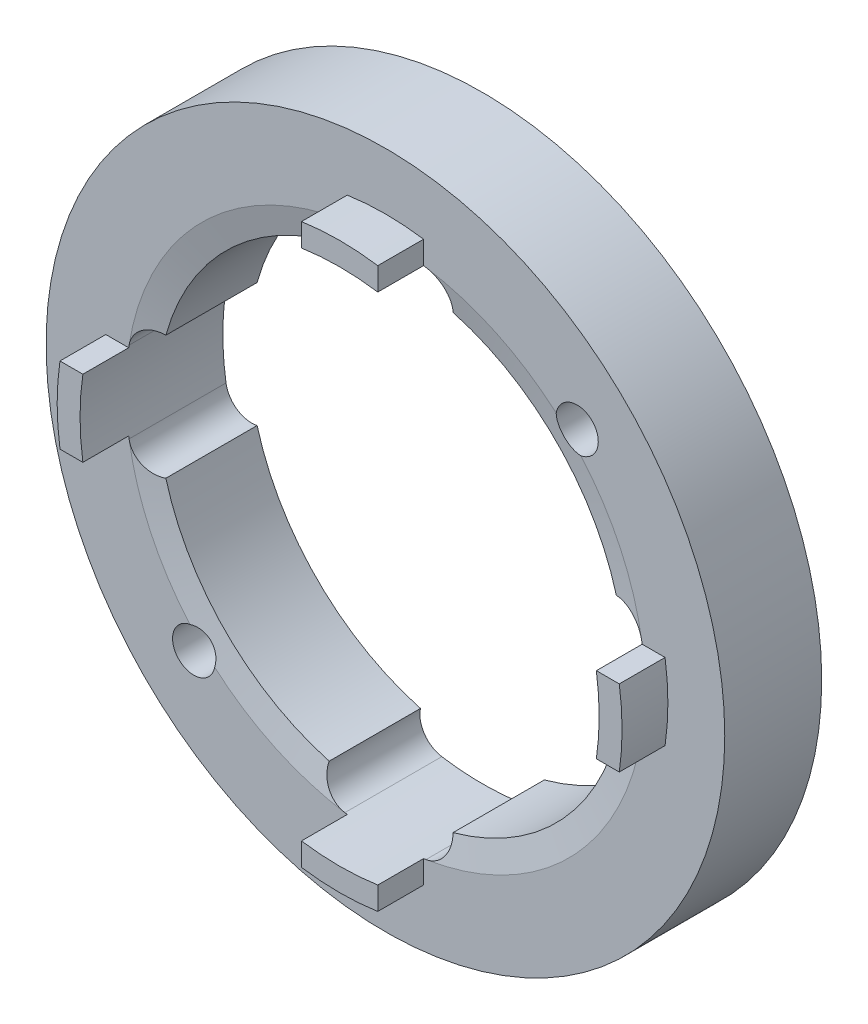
ISO-10303-21;
HEADER;
FILE_DESCRIPTION(('STEP AP214'),'2;1');
FILE_NAME('part.step','',(''),(''),'','','');
FILE_SCHEMA(('AUTOMOTIVE_DESIGN { 1 0 10303 214 1 1 1 1 }'));
ENDSEC;
DATA;
#1=APPLICATION_CONTEXT('core data for automotive mechanical design processes');
#2=APPLICATION_PROTOCOL_DEFINITION('international standard','automotive_design',2000,#1);
#3=PRODUCT_CONTEXT('',#1,'mechanical');
#4=PRODUCT('Part','Part','',(#3));
#5=PRODUCT_RELATED_PRODUCT_CATEGORY('part','',(#4));
#6=PRODUCT_DEFINITION_FORMATION('','',#4);
#7=PRODUCT_DEFINITION_CONTEXT('part definition',#1,'design');
#8=PRODUCT_DEFINITION('design','',#6,#7);
#9=PRODUCT_DEFINITION_SHAPE('','',#8);
#10=(LENGTH_UNIT() NAMED_UNIT(*) SI_UNIT(.MILLI.,.METRE.));
#11=(NAMED_UNIT(*) PLANE_ANGLE_UNIT() SI_UNIT($,.RADIAN.));
#12=(NAMED_UNIT(*) SI_UNIT($,.STERADIAN.) SOLID_ANGLE_UNIT());
#13=UNCERTAINTY_MEASURE_WITH_UNIT(LENGTH_MEASURE(1.E-05),#10,'distance_accuracy_value','');
#14=(GEOMETRIC_REPRESENTATION_CONTEXT(3) GLOBAL_UNCERTAINTY_ASSIGNED_CONTEXT((#13)) GLOBAL_UNIT_ASSIGNED_CONTEXT((#10,
#11,#12)) REPRESENTATION_CONTEXT('',''));
#15=CARTESIAN_POINT('',(0.,0.,0.));
#16=DIRECTION('',(0.,0.,1.));
#17=DIRECTION('',(1.,0.,0.));
#18=AXIS2_PLACEMENT_3D('',#15,#16,#17);
#19=CARTESIAN_POINT('',(0.,0.,0.));
#20=DIRECTION('',(0.,0.,1.));
#21=DIRECTION('',(1.,0.,0.));
#22=AXIS2_PLACEMENT_3D('',#19,#20,#21);
#23=PLANE('',#22);
#24=CARTESIAN_POINT('',(-12.5511453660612,-12.5511453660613,0.));
#25=DIRECTION('',(0.,0.,-1.));
#26=DIRECTION('',(-1.,0.,0.));
#27=AXIS2_PLACEMENT_3D('',#24,#25,#26);
#28=CIRCLE('',#27,1.38912599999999);
#29=CARTESIAN_POINT('',(-13.9402713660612,-12.5511453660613,0.));
#30=VERTEX_POINT('',#29);
#31=EDGE_CURVE('E271',#30,#30,#28,.T.);
#32=ORIENTED_EDGE('',*,*,#31,.F.);
#33=EDGE_LOOP('',(#32));
#34=FACE_BOUND('',#33,.T.);
#35=CARTESIAN_POINT('',(0.,0.,0.));
#36=DIRECTION('',(0.,0.,1.));
#37=DIRECTION('',(1.,0.,0.));
#38=AXIS2_PLACEMENT_3D('',#35,#36,#37);
#39=CIRCLE('',#38,22.225);
#40=CARTESIAN_POINT('',(22.225,0.,0.));
#41=VERTEX_POINT('',#40);
#42=EDGE_CURVE('E447',#41,#41,#39,.T.);
#43=ORIENTED_EDGE('',*,*,#42,.F.);
#44=EDGE_LOOP('',(#43));
#45=FACE_BOUND('',#44,.T.);
#46=CARTESIAN_POINT('',(0.,0.,0.));
#47=DIRECTION('',(0.,0.,1.));
#48=DIRECTION('',(1.,0.,0.));
#49=AXIS2_PLACEMENT_3D('',#46,#47,#48);
#50=CIRCLE('',#49,15.3);
#51=CARTESIAN_POINT('',(4.05514996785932,14.7528220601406,0.));
#52=VERTEX_POINT('',#51);
#53=CARTESIAN_POINT('',(14.7528220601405,4.05514996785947,0.));
#54=VERTEX_POINT('',#53);
#55=EDGE_CURVE('E453',#52,#54,#50,.F.);
#56=ORIENTED_EDGE('',*,*,#55,.F.);
#57=CARTESIAN_POINT('',(2.39344731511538,15.1116316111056,0.));
#58=DIRECTION('',(0.,0.,1.));
#59=DIRECTION('',(0.,-1.,0.));
#60=AXIS2_PLACEMENT_3D('',#57,#58,#59);
#61=CIRCLE('',#60,1.69999999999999);
#62=CARTESIAN_POINT('',(2.65938590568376,16.7907017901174,0.));
#63=VERTEX_POINT('',#62);
#64=EDGE_CURVE('E761',#52,#63,#61,.T.);
#65=ORIENTED_EDGE('',*,*,#64,.T.);
#66=CARTESIAN_POINT('',(0.,0.,0.));
#67=DIRECTION('',(0.,0.,1.));
#68=DIRECTION('',(0.,-1.,0.));
#69=AXIS2_PLACEMENT_3D('',#66,#67,#68);
#70=CIRCLE('',#69,17.);
#71=CARTESIAN_POINT('',(-2.65938590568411,16.7907017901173,0.));
#72=VERTEX_POINT('',#71);
#73=EDGE_CURVE('E776',#63,#72,#70,.T.);
#74=ORIENTED_EDGE('',*,*,#73,.T.);
#75=CARTESIAN_POINT('',(-2.3934473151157,15.1116316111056,0.));
#76=DIRECTION('',(0.,0.,1.));
#77=DIRECTION('',(0.,-1.,0.));
#78=AXIS2_PLACEMENT_3D('',#75,#76,#77);
#79=CIRCLE('',#78,1.7);
#80=CARTESIAN_POINT('',(-4.05514996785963,14.7528220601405,0.));
#81=VERTEX_POINT('',#80);
#82=EDGE_CURVE('E770',#72,#81,#79,.T.);
#83=ORIENTED_EDGE('',*,*,#82,.T.);
#84=CARTESIAN_POINT('',(-14.7528220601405,4.05514996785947,0.));
#85=VERTEX_POINT('',#84);
#86=EDGE_CURVE('E450',#85,#81,#50,.F.);
#87=ORIENTED_EDGE('',*,*,#86,.F.);
#88=CARTESIAN_POINT('',(-15.1116316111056,2.39344731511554,0.));
#89=DIRECTION('',(0.,0.,1.));
#90=DIRECTION('',(1.,0.,0.));
#91=AXIS2_PLACEMENT_3D('',#88,#89,#90);
#92=CIRCLE('',#91,1.69999999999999);
#93=CARTESIAN_POINT('',(-16.7907017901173,2.65938590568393,0.));
#94=VERTEX_POINT('',#93);
#95=EDGE_CURVE('E580',#85,#94,#92,.T.);
#96=ORIENTED_EDGE('',*,*,#95,.T.);
#97=CARTESIAN_POINT('',(0.,0.,0.));
#98=DIRECTION('',(0.,0.,1.));
#99=DIRECTION('',(1.,0.,0.));
#100=AXIS2_PLACEMENT_3D('',#97,#98,#99);
#101=CIRCLE('',#100,17.);
#102=CARTESIAN_POINT('',(-16.7907017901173,-2.65938590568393,0.));
#103=VERTEX_POINT('',#102);
#104=EDGE_CURVE('E583',#94,#103,#101,.T.);
#105=ORIENTED_EDGE('',*,*,#104,.T.);
#106=CARTESIAN_POINT('',(-15.1116316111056,-2.39344731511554,0.));
#107=DIRECTION('',(0.,0.,1.));
#108=DIRECTION('',(1.,0.,0.));
#109=AXIS2_PLACEMENT_3D('',#106,#107,#108);
#110=CIRCLE('',#109,1.7);
#111=CARTESIAN_POINT('',(-14.7528220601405,-4.05514996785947,0.));
#112=VERTEX_POINT('',#111);
#113=EDGE_CURVE('E586',#103,#112,#110,.T.);
#114=ORIENTED_EDGE('',*,*,#113,.T.);
#115=CARTESIAN_POINT('',(-4.05514996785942,-14.7528220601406,0.));
#116=VERTEX_POINT('',#115);
#117=EDGE_CURVE('E446',#116,#112,#50,.F.);
#118=ORIENTED_EDGE('',*,*,#117,.F.);
#119=CARTESIAN_POINT('',(-2.39344731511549,-15.1116316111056,0.));
#120=DIRECTION('',(0.,0.,1.));
#121=DIRECTION('',(0.,1.,0.));
#122=AXIS2_PLACEMENT_3D('',#119,#120,#121);
#123=CIRCLE('',#122,1.69999999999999);
#124=CARTESIAN_POINT('',(-2.65938590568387,-16.7907017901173,0.));
#125=VERTEX_POINT('',#124);
#126=EDGE_CURVE('E487',#116,#125,#123,.T.);
#127=ORIENTED_EDGE('',*,*,#126,.T.);
#128=CARTESIAN_POINT('',(0.,0.,0.));
#129=DIRECTION('',(0.,0.,1.));
#130=DIRECTION('',(0.,1.,0.));
#131=AXIS2_PLACEMENT_3D('',#128,#129,#130);
#132=CIRCLE('',#131,17.);
#133=CARTESIAN_POINT('',(2.65938590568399,-16.7907017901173,0.));
#134=VERTEX_POINT('',#133);
#135=EDGE_CURVE('E482',#125,#134,#132,.T.);
#136=ORIENTED_EDGE('',*,*,#135,.T.);
#137=CARTESIAN_POINT('',(2.39344731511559,-15.1116316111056,0.));
#138=DIRECTION('',(0.,0.,1.));
#139=DIRECTION('',(0.,1.,0.));
#140=AXIS2_PLACEMENT_3D('',#137,#138,#139);
#141=CIRCLE('',#140,1.7);
#142=CARTESIAN_POINT('',(4.05514996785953,-14.7528220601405,0.));
#143=VERTEX_POINT('',#142);
#144=EDGE_CURVE('E473',#134,#143,#141,.T.);
#145=ORIENTED_EDGE('',*,*,#144,.T.);
#146=CARTESIAN_POINT('',(14.7528220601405,-4.05514996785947,0.));
#147=VERTEX_POINT('',#146);
#148=EDGE_CURVE('E458',#147,#143,#50,.F.);
#149=ORIENTED_EDGE('',*,*,#148,.F.);
#150=CARTESIAN_POINT('',(15.1116316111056,-2.39344731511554,0.));
#151=DIRECTION('',(0.,0.,1.));
#152=DIRECTION('',(-1.,0.,0.));
#153=AXIS2_PLACEMENT_3D('',#150,#151,#152);
#154=CIRCLE('',#153,1.69999999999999);
#155=CARTESIAN_POINT('',(16.7907017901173,-2.65938590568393,0.));
#156=VERTEX_POINT('',#155);
#157=EDGE_CURVE('E690',#147,#156,#154,.T.);
#158=ORIENTED_EDGE('',*,*,#157,.T.);
#159=CARTESIAN_POINT('',(0.,0.,0.));
#160=DIRECTION('',(0.,0.,1.));
#161=DIRECTION('',(-1.,0.,0.));
#162=AXIS2_PLACEMENT_3D('',#159,#160,#161);
#163=CIRCLE('',#162,17.);
#164=CARTESIAN_POINT('',(16.7907017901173,2.65938590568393,0.));
#165=VERTEX_POINT('',#164);
#166=EDGE_CURVE('E318',#156,#165,#163,.T.);
#167=ORIENTED_EDGE('',*,*,#166,.T.);
#168=CARTESIAN_POINT('',(15.1116316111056,2.39344731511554,0.));
#169=DIRECTION('',(0.,0.,1.));
#170=DIRECTION('',(-1.,0.,0.));
#171=AXIS2_PLACEMENT_3D('',#168,#169,#170);
#172=CIRCLE('',#171,1.7);
#173=EDGE_CURVE('E322',#165,#54,#172,.T.);
#174=ORIENTED_EDGE('',*,*,#173,.T.);
#175=EDGE_LOOP('',(#56,#65,#74,#83,#87,#96,#105,#114,#118,#127,#136,#145,#149,#158,#167,#174));
#176=FACE_BOUND('',#175,.T.);
#177=CARTESIAN_POINT('',(12.5511453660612,12.5511453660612,0.));
#178=DIRECTION('',(0.,0.,-1.));
#179=DIRECTION('',(-1.,0.,0.));
#180=AXIS2_PLACEMENT_3D('',#177,#178,#179);
#181=CIRCLE('',#180,1.38912599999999);
#182=CARTESIAN_POINT('',(11.1620193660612,12.5511453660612,0.));
#183=VERTEX_POINT('',#182);
#184=EDGE_CURVE('E270',#183,#183,#181,.T.);
#185=ORIENTED_EDGE('',*,*,#184,.F.);
#186=EDGE_LOOP('',(#185));
#187=FACE_BOUND('',#186,.T.);
#188=ADVANCED_FACE('F35',(#34,#45,#176,#187),#23,.F.);
#189=CARTESIAN_POINT('',(0.,0.,-0.00100000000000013));
#190=DIRECTION('',(0.,0.,1.));
#191=DIRECTION('',(1.,0.,0.));
#192=AXIS2_PLACEMENT_3D('',#189,#190,#191);
#193=CYLINDRICAL_SURFACE('',#192,15.3);
#194=CARTESIAN_POINT('',(0.,0.,5.97803444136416));
#195=DIRECTION('',(0.,0.,1.));
#196=DIRECTION('',(1.,0.,0.));
#197=AXIS2_PLACEMENT_3D('',#194,#195,#196);
#198=CIRCLE('',#197,15.3);
#199=CARTESIAN_POINT('',(14.7528220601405,4.05514996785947,5.97803444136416));
#200=VERTEX_POINT('',#199);
#201=CARTESIAN_POINT('',(4.05514996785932,14.7528220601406,5.97803444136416));
#202=VERTEX_POINT('',#201);
#203=EDGE_CURVE('E295',#200,#202,#198,.T.);
#204=ORIENTED_EDGE('',*,*,#203,.T.);
#205=DIRECTION('',(0.,0.,1.));
#206=VECTOR('',#205,1.);
#207=CARTESIAN_POINT('',(4.05514996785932,14.7528220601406,2.98901722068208));
#208=LINE('',#207,#206);
#209=EDGE_CURVE('E691',#202,#52,#208,.F.);
#210=ORIENTED_EDGE('',*,*,#209,.T.);
#211=ORIENTED_EDGE('',*,*,#55,.T.);
#212=DIRECTION('',(0.,0.,1.));
#213=VECTOR('',#212,1.);
#214=CARTESIAN_POINT('',(14.7528220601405,4.05514996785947,2.98901722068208));
#215=LINE('',#214,#213);
#216=EDGE_CURVE('E698',#54,#200,#215,.T.);
#217=ORIENTED_EDGE('',*,*,#216,.T.);
#218=EDGE_LOOP('',(#204,#210,#211,#217));
#219=FACE_BOUND('',#218,.T.);
#220=ADVANCED_FACE('F651',(#219),#193,.F.);
#221=CARTESIAN_POINT('',(0.,0.,4.81837711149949));
#222=DIRECTION('',(0.,0.,1.));
#223=DIRECTION('',(1.,0.,0.));
#224=AXIS2_PLACEMENT_3D('',#221,#222,#223);
#225=CONICAL_SURFACE('',#224,10.,1.35538779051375);
#226=CARTESIAN_POINT('',(0.,0.,6.35));
#227=DIRECTION('',(0.,0.,-1.));
#228=DIRECTION('',(-1.,0.,0.));
#229=AXIS2_PLACEMENT_3D('',#226,#227,#228);
#230=CIRCLE('',#229,17.);
#231=CARTESIAN_POINT('',(12.8022612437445,11.1849053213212,6.35));
#232=VERTEX_POINT('',#231);
#233=CARTESIAN_POINT('',(16.7907017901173,2.65938590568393,6.35));
#234=VERTEX_POINT('',#233);
#235=EDGE_CURVE('E279',#232,#234,#230,.T.);
#236=ORIENTED_EDGE('',*,*,#235,.F.);
#237=CARTESIAN_POINT('',(12.8033067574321,11.1850979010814,6.35020000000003));
#238=CARTESIAN_POINT('',(12.7652165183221,11.1780673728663,6.34291154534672));
#239=CARTESIAN_POINT('',(12.7268153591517,11.172626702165,6.33580804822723));
#240=CARTESIAN_POINT('',(12.6496151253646,11.1649702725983,6.32202186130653));
#241=CARTESIAN_POINT('',(12.6108160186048,11.162754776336,6.31533920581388));
#242=CARTESIAN_POINT('',(12.4942110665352,11.1610158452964,6.29600787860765));
#243=CARTESIAN_POINT('',(12.4161540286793,11.166391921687,6.28406749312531));
#244=CARTESIAN_POINT('',(12.2616824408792,11.1902617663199,6.26252570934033));
#245=CARTESIAN_POINT('',(12.1852697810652,11.2087698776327,6.25292688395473));
#246=CARTESIAN_POINT('',(12.0364271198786,11.258518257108,6.2364525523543));
#247=CARTESIAN_POINT('',(11.9639947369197,11.2897508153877,6.22957540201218));
#248=CARTESIAN_POINT('',(11.8265548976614,11.3634540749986,6.21891886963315));
#249=CARTESIAN_POINT('',(11.761436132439,11.4057094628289,6.21508528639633));
#250=CARTESIAN_POINT('',(11.6390594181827,11.500544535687,6.21046574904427));
#251=CARTESIAN_POINT('',(11.5818028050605,11.5531259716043,6.20968031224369));
#252=CARTESIAN_POINT('',(11.477732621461,11.6661255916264,6.21117900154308));
#253=CARTESIAN_POINT('',(11.430762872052,11.7264007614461,6.21341288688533));
#254=CARTESIAN_POINT('',(11.3473966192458,11.8536882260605,6.22077091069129));
#255=CARTESIAN_POINT('',(11.3109980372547,11.9206991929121,6.22589448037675));
#256=CARTESIAN_POINT('',(11.2496526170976,12.0596512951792,6.23884064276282));
#257=CARTESIAN_POINT('',(11.2247246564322,12.1316003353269,6.24666764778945));
#258=CARTESIAN_POINT('',(11.1869666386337,12.2783329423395,6.26472956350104));
#259=CARTESIAN_POINT('',(11.1741386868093,12.353117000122,6.274964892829));
#260=CARTESIAN_POINT('',(11.1618895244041,12.4910459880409,6.29562162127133));
#261=CARTESIAN_POINT('',(11.160609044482,12.5540804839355,6.30573505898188));
#262=CARTESIAN_POINT('',(11.1665318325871,12.6794635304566,6.3271401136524));
#263=CARTESIAN_POINT('',(11.1737239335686,12.7418128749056,6.33843016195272));
#264=CARTESIAN_POINT('',(11.1850979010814,12.8033067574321,6.35020000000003));
#265=B_SPLINE_CURVE_WITH_KNOTS('',3,(#237,#238,#239,#240,#241,#242,#243,#244,#245,#246,#247,
#248,#249,#250,#251,#252,#253,#254,#255,#256,#257,#258,#259,#260,#261,#262,#263,#264),
.UNSPECIFIED.,.F.,.F.,(4,2,2,2,2,2,2,2,2,2,2,2,2,4),(0.,0.118171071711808,0.236351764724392,
0.472579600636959,0.709065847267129,0.945409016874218,1.17744245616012,1.40951527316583,
1.6377736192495,1.8659870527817,2.09457473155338,2.32320217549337,2.51419581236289,
2.70493799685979),.UNSPECIFIED.);
#266=CARTESIAN_POINT('',(11.1849053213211,12.8022612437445,6.35));
#267=VERTEX_POINT('',#266);
#268=EDGE_CURVE('E48',#232,#267,#265,.T.);
#269=ORIENTED_EDGE('',*,*,#268,.T.);
#270=CARTESIAN_POINT('',(2.65938590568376,16.7907017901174,6.35));
#271=VERTEX_POINT('',#270);
#272=EDGE_CURVE('E288',#271,#267,#230,.T.);
#273=ORIENTED_EDGE('',*,*,#272,.F.);
#274=CARTESIAN_POINT('',(2.65812006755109,16.7909017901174,6.34999990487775));
#275=CARTESIAN_POINT('',(2.70470251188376,16.7835600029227,6.35000674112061));
#276=CARTESIAN_POINT('',(2.75095674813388,16.7742819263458,6.34962727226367));
#277=CARTESIAN_POINT('',(2.84251981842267,16.7519232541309,6.34809880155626));
#278=CARTESIAN_POINT('',(2.88782873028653,16.7388429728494,6.34694986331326));
#279=CARTESIAN_POINT('',(3.02172201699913,16.6940663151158,6.34236000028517));
#280=CARTESIAN_POINT('',(3.10847711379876,16.6568016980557,6.33777602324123));
#281=CARTESIAN_POINT('',(3.27446068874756,16.5685684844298,6.325668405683));
#282=CARTESIAN_POINT('',(3.35368684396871,16.5175956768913,6.31814386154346));
#283=CARTESIAN_POINT('',(3.50247209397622,16.4034713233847,6.30033504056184));
#284=CARTESIAN_POINT('',(3.57203126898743,16.3403198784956,6.29005078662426));
#285=CARTESIAN_POINT('',(3.70012991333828,16.2031697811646,6.26687592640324));
#286=CARTESIAN_POINT('',(3.75857981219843,16.129090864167,6.25396574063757));
#287=CARTESIAN_POINT('',(3.86230466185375,15.9726029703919,6.2258936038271));
#288=CARTESIAN_POINT('',(3.90757810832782,15.8901930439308,6.21073139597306));
#289=CARTESIAN_POINT('',(3.98454320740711,15.7178337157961,6.17822051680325));
#290=CARTESIAN_POINT('',(4.01597663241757,15.6277755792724,6.16083750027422));
#291=CARTESIAN_POINT('',(4.06334754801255,15.4439613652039,6.12452107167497));
#292=CARTESIAN_POINT('',(4.07928352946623,15.3502049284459,6.10558750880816));
#293=CARTESIAN_POINT('',(4.09449689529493,15.1715634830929,6.06869270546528));
#294=CARTESIAN_POINT('',(4.09535449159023,15.0867861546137,6.05083964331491));
#295=CARTESIAN_POINT('',(4.0845263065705,14.9182001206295,6.01462964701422));
#296=CARTESIAN_POINT('',(4.07284822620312,14.8343908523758,5.99627302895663));
#297=CARTESIAN_POINT('',(4.05495650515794,14.7519272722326,5.97783444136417));
#298=B_SPLINE_CURVE_WITH_KNOTS('',3,(#274,#275,#276,#277,#278,#279,#280,#281,#282,#283,#284,
#285,#286,#287,#288,#289,#290,#291,#292,#293,#294,#295,#296,#297),.UNSPECIFIED.,.F.,.F.,(4,2,2,
2,2,2,2,2,2,2,2,4),(0.,0.1413847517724,0.282757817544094,0.564891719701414,0.847112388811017,
1.12933071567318,1.41373599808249,1.698173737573,1.98771427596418,2.27728300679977,
2.53630002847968,2.79515802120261),.UNSPECIFIED.);
#299=EDGE_CURVE('E719',#271,#202,#298,.T.);
#300=ORIENTED_EDGE('',*,*,#299,.T.);
#301=ORIENTED_EDGE('',*,*,#203,.F.);
#302=CARTESIAN_POINT('',(14.7519272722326,4.0549565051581,5.97783444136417));
#303=CARTESIAN_POINT('',(14.7994277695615,4.06523906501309,5.98845260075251));
#304=CARTESIAN_POINT('',(14.847352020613,4.07348152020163,5.99904140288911));
#305=CARTESIAN_POINT('',(14.9437560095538,4.08583685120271,6.02009966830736));
#306=CARTESIAN_POINT('',(14.992235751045,4.08994970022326,6.03056913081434));
#307=CARTESIAN_POINT('',(15.1379710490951,4.09601553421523,6.06168639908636));
#308=CARTESIAN_POINT('',(15.235619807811,4.0917167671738,6.08206477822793));
#309=CARTESIAN_POINT('',(15.4290246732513,4.06640651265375,6.1215362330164));
#310=CARTESIAN_POINT('',(15.524779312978,4.04538255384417,6.14062833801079));
#311=CARTESIAN_POINT('',(15.7115494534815,3.98707800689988,6.17702957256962));
#312=CARTESIAN_POINT('',(15.8025665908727,3.94980307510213,6.19433931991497));
#313=CARTESIAN_POINT('',(15.9761524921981,3.86042716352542,6.2265563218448));
#314=CARTESIAN_POINT('',(16.0588040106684,3.80849581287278,6.24148817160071));
#315=CARTESIAN_POINT('',(16.2142816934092,3.69100416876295,6.26880566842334));
#316=CARTESIAN_POINT('',(16.2871073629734,3.6254431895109,6.28119118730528));
#317=CARTESIAN_POINT('',(16.419292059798,3.48395831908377,6.30287985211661));
#318=CARTESIAN_POINT('',(16.4788890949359,3.40826521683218,6.31223915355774));
#319=CARTESIAN_POINT('',(16.5845478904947,3.24769682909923,6.32796970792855));
#320=CARTESIAN_POINT('',(16.630616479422,3.16282620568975,6.33434246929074));
#321=CARTESIAN_POINT('',(16.6982393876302,3.00821278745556,6.3427567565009));
#322=CARTESIAN_POINT('',(16.7230376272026,2.9399036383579,6.34547896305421));
#323=CARTESIAN_POINT('',(16.7637296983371,2.80068955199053,6.34910689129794));
#324=CARTESIAN_POINT('',(16.7796297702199,2.72978647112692,6.35001388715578));
#325=CARTESIAN_POINT('',(16.7909017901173,2.6581200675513,6.34999990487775));
#326=B_SPLINE_CURVE_WITH_KNOTS('',3,(#302,#303,#304,#305,#306,#307,#308,#309,#310,#311,#312,
#313,#314,#315,#316,#317,#318,#319,#320,#321,#322,#323,#324,#325),.UNSPECIFIED.,.F.,.F.,(4,2,2,
2,2,2,2,2,2,2,2,4),(0.,0.149150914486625,0.298302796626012,0.59630528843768,0.894530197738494,
1.1926513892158,1.48745453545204,1.78227251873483,2.0712553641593,2.36009209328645,
2.57766870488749,2.79509253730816),.UNSPECIFIED.);
#327=EDGE_CURVE('E341',#200,#234,#326,.T.);
#328=ORIENTED_EDGE('',*,*,#327,.T.);
#329=EDGE_LOOP('',(#236,#269,#273,#300,#301,#328));
#330=FACE_BOUND('',#329,.T.);
#331=ADVANCED_FACE('F656',(#330),#225,.F.);
#332=CARTESIAN_POINT('',(4.05514996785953,-14.7528220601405,5.97803444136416));
#333=VERTEX_POINT('',#332);
#334=CARTESIAN_POINT('',(14.7528220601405,-4.05514996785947,5.97803444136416));
#335=VERTEX_POINT('',#334);
#336=EDGE_CURVE('E332',#333,#335,#198,.T.);
#337=ORIENTED_EDGE('',*,*,#336,.T.);
#338=DIRECTION('',(0.,0.,1.));
#339=VECTOR('',#338,1.);
#340=CARTESIAN_POINT('',(14.7528220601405,-4.05514996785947,3.175));
#341=LINE('',#340,#339);
#342=EDGE_CURVE('E469',#335,#147,#341,.F.);
#343=ORIENTED_EDGE('',*,*,#342,.T.);
#344=ORIENTED_EDGE('',*,*,#148,.T.);
#345=DIRECTION('',(0.,0.,1.));
#346=VECTOR('',#345,1.);
#347=CARTESIAN_POINT('',(4.05514996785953,-14.7528220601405,2.98901722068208));
#348=LINE('',#347,#346);
#349=EDGE_CURVE('E468',#143,#333,#348,.T.);
#350=ORIENTED_EDGE('',*,*,#349,.T.);
#351=EDGE_LOOP('',(#337,#343,#344,#350));
#352=FACE_BOUND('',#351,.T.);
#353=ADVANCED_FACE('F467',(#352),#193,.F.);
#354=CARTESIAN_POINT('',(16.7907017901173,-2.65938590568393,6.35));
#355=VERTEX_POINT('',#354);
#356=CARTESIAN_POINT('',(2.65938590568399,-16.7907017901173,6.35));
#357=VERTEX_POINT('',#356);
#358=EDGE_CURVE('E283',#355,#357,#230,.T.);
#359=ORIENTED_EDGE('',*,*,#358,.F.);
#360=CARTESIAN_POINT('',(16.7909017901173,-2.65812006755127,6.34999990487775));
#361=CARTESIAN_POINT('',(16.7835600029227,-2.70470251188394,6.35000674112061));
#362=CARTESIAN_POINT('',(16.7742819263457,-2.75095674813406,6.34962727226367));
#363=CARTESIAN_POINT('',(16.7519232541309,-2.84251981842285,6.34809880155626));
#364=CARTESIAN_POINT('',(16.7388429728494,-2.88782873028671,6.34694986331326));
#365=CARTESIAN_POINT('',(16.6940663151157,-3.02172201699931,6.34236000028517));
#366=CARTESIAN_POINT('',(16.6568016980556,-3.10847711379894,6.33777602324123));
#367=CARTESIAN_POINT('',(16.5685684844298,-3.27446068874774,6.325668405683));
#368=CARTESIAN_POINT('',(16.5175956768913,-3.35368684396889,6.31814386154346));
#369=CARTESIAN_POINT('',(16.4034713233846,-3.5024720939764,6.30033504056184));
#370=CARTESIAN_POINT('',(16.3403198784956,-3.5720312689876,6.29005078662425));
#371=CARTESIAN_POINT('',(16.2031697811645,-3.70012991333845,6.26687592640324));
#372=CARTESIAN_POINT('',(16.129090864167,-3.75857981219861,6.25396574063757));
#373=CARTESIAN_POINT('',(15.9726029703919,-3.86230466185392,6.2258936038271));
#374=CARTESIAN_POINT('',(15.8901930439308,-3.90757810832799,6.21073139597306));
#375=CARTESIAN_POINT('',(15.717833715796,-3.98454320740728,6.17822051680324));
#376=CARTESIAN_POINT('',(15.6277755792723,-4.01597663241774,6.16083750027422));
#377=CARTESIAN_POINT('',(15.4439613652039,-4.06334754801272,6.12452107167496));
#378=CARTESIAN_POINT('',(15.3502049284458,-4.07928352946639,6.10558750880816));
#379=CARTESIAN_POINT('',(15.1715634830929,-4.09449689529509,6.06869270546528));
#380=CARTESIAN_POINT('',(15.0867861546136,-4.09535449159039,6.05083964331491));
#381=CARTESIAN_POINT('',(14.9182001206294,-4.08452630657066,6.01462964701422));
#382=CARTESIAN_POINT('',(14.8343908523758,-4.07284822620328,5.99627302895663));
#383=CARTESIAN_POINT('',(14.7519272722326,-4.0549565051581,5.97783444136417));
#384=B_SPLINE_CURVE_WITH_KNOTS('',3,(#360,#361,#362,#363,#364,#365,#366,#367,#368,#369,#370,
#371,#372,#373,#374,#375,#376,#377,#378,#379,#380,#381,#382,#383),.UNSPECIFIED.,.F.,.F.,(4,2,2,
2,2,2,2,2,2,2,2,4),(0.,0.141384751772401,0.282757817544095,0.564891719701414,0.847112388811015,
1.12933071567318,1.41373599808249,1.698173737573,1.98771427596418,2.27728300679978,
2.53630002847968,2.7951580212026),.UNSPECIFIED.);
#385=EDGE_CURVE('E329',#355,#335,#384,.T.);
#386=ORIENTED_EDGE('',*,*,#385,.T.);
#387=ORIENTED_EDGE('',*,*,#336,.F.);
#388=CARTESIAN_POINT('',(4.05495650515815,-14.7519272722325,5.97783444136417));
#389=CARTESIAN_POINT('',(4.06523906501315,-14.7994277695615,5.98845260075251));
#390=CARTESIAN_POINT('',(4.07348152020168,-14.847352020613,5.9990414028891));
#391=CARTESIAN_POINT('',(4.08583685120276,-14.9437560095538,6.02009966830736));
#392=CARTESIAN_POINT('',(4.08994970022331,-14.992235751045,6.03056913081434));
#393=CARTESIAN_POINT('',(4.09601553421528,-15.1379710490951,6.06168639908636));
#394=CARTESIAN_POINT('',(4.09171676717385,-15.235619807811,6.08206477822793));
#395=CARTESIAN_POINT('',(4.06640651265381,-15.4290246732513,6.1215362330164));
#396=CARTESIAN_POINT('',(4.04538255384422,-15.524779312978,6.14062833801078));
#397=CARTESIAN_POINT('',(3.98707800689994,-15.7115494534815,6.17702957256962));
#398=CARTESIAN_POINT('',(3.94980307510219,-15.8025665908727,6.19433931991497));
#399=CARTESIAN_POINT('',(3.86042716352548,-15.9761524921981,6.2265563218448));
#400=CARTESIAN_POINT('',(3.80849581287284,-16.0588040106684,6.24148817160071));
#401=CARTESIAN_POINT('',(3.69100416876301,-16.2142816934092,6.26880566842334));
#402=CARTESIAN_POINT('',(3.62544318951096,-16.2871073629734,6.28119118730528));
#403=CARTESIAN_POINT('',(3.48395831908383,-16.419292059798,6.30287985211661));
#404=CARTESIAN_POINT('',(3.40826521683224,-16.4788890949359,6.31223915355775));
#405=CARTESIAN_POINT('',(3.24769682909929,-16.5845478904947,6.32796970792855));
#406=CARTESIAN_POINT('',(3.16282620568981,-16.630616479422,6.33434246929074));
#407=CARTESIAN_POINT('',(3.00821278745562,-16.6982393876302,6.3427567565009));
#408=CARTESIAN_POINT('',(2.93990363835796,-16.7230376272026,6.34547896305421));
#409=CARTESIAN_POINT('',(2.80068955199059,-16.7637296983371,6.34910689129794));
#410=CARTESIAN_POINT('',(2.72978647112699,-16.7796297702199,6.35001388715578));
#411=CARTESIAN_POINT('',(2.65812006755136,-16.7909017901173,6.34999990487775));
#412=B_SPLINE_CURVE_WITH_KNOTS('',3,(#388,#389,#390,#391,#392,#393,#394,#395,#396,#397,#398,
#399,#400,#401,#402,#403,#404,#405,#406,#407,#408,#409,#410,#411),.UNSPECIFIED.,.F.,.F.,(4,2,2,
2,2,2,2,2,2,2,2,4),(0.,0.149150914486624,0.29830279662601,0.59630528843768,0.894530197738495,
1.1926513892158,1.48745453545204,1.78227251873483,2.0712553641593,2.36009209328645,
2.57766870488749,2.79509253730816),.UNSPECIFIED.);
#413=EDGE_CURVE('E331',#333,#357,#412,.T.);
#414=ORIENTED_EDGE('',*,*,#413,.T.);
#415=EDGE_LOOP('',(#359,#386,#387,#414));
#416=FACE_BOUND('',#415,.T.);
#417=ADVANCED_FACE('F327',(#416),#225,.F.);
#418=CARTESIAN_POINT('',(-14.7528220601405,-4.05514996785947,5.97803444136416));
#419=VERTEX_POINT('',#418);
#420=CARTESIAN_POINT('',(-4.05514996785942,-14.7528220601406,5.97803444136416));
#421=VERTEX_POINT('',#420);
#422=EDGE_CURVE('E297',#419,#421,#198,.T.);
#423=ORIENTED_EDGE('',*,*,#422,.T.);
#424=DIRECTION('',(0.,0.,1.));
#425=VECTOR('',#424,1.);
#426=CARTESIAN_POINT('',(-4.05514996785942,-14.7528220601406,3.175));
#427=LINE('',#426,#425);
#428=EDGE_CURVE('E475',#421,#116,#427,.F.);
#429=ORIENTED_EDGE('',*,*,#428,.T.);
#430=ORIENTED_EDGE('',*,*,#117,.T.);
#431=DIRECTION('',(0.,0.,1.));
#432=VECTOR('',#431,1.);
#433=CARTESIAN_POINT('',(-14.7528220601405,-4.05514996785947,3.175));
#434=LINE('',#433,#432);
#435=EDGE_CURVE('E594',#112,#419,#434,.T.);
#436=ORIENTED_EDGE('',*,*,#435,.T.);
#437=EDGE_LOOP('',(#423,#429,#430,#436));
#438=FACE_BOUND('',#437,.T.);
#439=ADVANCED_FACE('F664',(#438),#193,.F.);
#440=CARTESIAN_POINT('',(-12.8022612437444,-11.1849053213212,6.35));
#441=VERTEX_POINT('',#440);
#442=CARTESIAN_POINT('',(-16.7907017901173,-2.65938590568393,6.35));
#443=VERTEX_POINT('',#442);
#444=EDGE_CURVE('E266',#441,#443,#230,.T.);
#445=ORIENTED_EDGE('',*,*,#444,.F.);
#446=CARTESIAN_POINT('',(-12.8033067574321,-11.1850979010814,6.35020000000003));
#447=CARTESIAN_POINT('',(-12.7652165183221,-11.1780673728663,6.34291154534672));
#448=CARTESIAN_POINT('',(-12.7268153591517,-11.172626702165,6.33580804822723));
#449=CARTESIAN_POINT('',(-12.6496151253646,-11.1649702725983,6.32202186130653));
#450=CARTESIAN_POINT('',(-12.6108160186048,-11.1627547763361,6.31533920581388));
#451=CARTESIAN_POINT('',(-12.4942110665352,-11.1610158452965,6.29600787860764));
#452=CARTESIAN_POINT('',(-12.4161540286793,-11.166391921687,6.28406749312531));
#453=CARTESIAN_POINT('',(-12.2616824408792,-11.19026176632,6.26252570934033));
#454=CARTESIAN_POINT('',(-12.1852697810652,-11.2087698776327,6.25292688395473));
#455=CARTESIAN_POINT('',(-12.0364271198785,-11.258518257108,6.2364525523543));
#456=CARTESIAN_POINT('',(-11.9639947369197,-11.2897508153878,6.22957540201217));
#457=CARTESIAN_POINT('',(-11.8265548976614,-11.3634540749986,6.21891886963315));
#458=CARTESIAN_POINT('',(-11.761436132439,-11.4057094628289,6.21508528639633));
#459=CARTESIAN_POINT('',(-11.6390594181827,-11.5005445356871,6.21046574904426));
#460=CARTESIAN_POINT('',(-11.5818028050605,-11.5531259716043,6.20968031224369));
#461=CARTESIAN_POINT('',(-11.4777326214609,-11.6661255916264,6.21117900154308));
#462=CARTESIAN_POINT('',(-11.430762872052,-11.7264007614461,6.21341288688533));
#463=CARTESIAN_POINT('',(-11.3473966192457,-11.8536882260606,6.22077091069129));
#464=CARTESIAN_POINT('',(-11.3109980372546,-11.9206991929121,6.22589448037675));
#465=CARTESIAN_POINT('',(-11.2496526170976,-12.0596512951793,6.23884064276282));
#466=CARTESIAN_POINT('',(-11.2247246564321,-12.131600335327,6.24666764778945));
#467=CARTESIAN_POINT('',(-11.1869666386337,-12.2783329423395,6.26472956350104));
#468=CARTESIAN_POINT('',(-11.1741386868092,-12.353117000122,6.274964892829));
#469=CARTESIAN_POINT('',(-11.1618895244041,-12.491045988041,6.29562162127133));
#470=CARTESIAN_POINT('',(-11.160609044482,-12.5540804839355,6.30573505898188));
#471=CARTESIAN_POINT('',(-11.166531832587,-12.6794635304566,6.3271401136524));
#472=CARTESIAN_POINT('',(-11.1737239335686,-12.7418128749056,6.33843016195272));
#473=CARTESIAN_POINT('',(-11.1850979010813,-12.8033067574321,6.35020000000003));
#474=B_SPLINE_CURVE_WITH_KNOTS('',3,(#446,#447,#448,#449,#450,#451,#452,#453,#454,#455,#456,
#457,#458,#459,#460,#461,#462,#463,#464,#465,#466,#467,#468,#469,#470,#471,#472,#473),
.UNSPECIFIED.,.F.,.F.,(4,2,2,2,2,2,2,2,2,2,2,2,2,4),(0.,0.118171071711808,0.236351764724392,
0.47257960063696,0.709065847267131,0.94540901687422,1.17744245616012,1.40951527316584,
1.6377736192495,1.8659870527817,2.09457473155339,2.32320217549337,2.51419581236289,
2.70493799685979),.UNSPECIFIED.);
#475=CARTESIAN_POINT('',(-11.1849053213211,-12.8022612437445,6.35));
#476=VERTEX_POINT('',#475);
#477=EDGE_CURVE('E11',#441,#476,#474,.T.);
#478=ORIENTED_EDGE('',*,*,#477,.T.);
#479=CARTESIAN_POINT('',(-2.65938590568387,-16.7907017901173,6.35));
#480=VERTEX_POINT('',#479);
#481=EDGE_CURVE('E269',#480,#476,#230,.T.);
#482=ORIENTED_EDGE('',*,*,#481,.F.);
#483=CARTESIAN_POINT('',(-2.65812006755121,-16.7909017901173,6.34999990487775));
#484=CARTESIAN_POINT('',(-2.70470251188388,-16.7835600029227,6.35000674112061));
#485=CARTESIAN_POINT('',(-2.750956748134,-16.7742819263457,6.34962727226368));
#486=CARTESIAN_POINT('',(-2.84251981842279,-16.7519232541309,6.34809880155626));
#487=CARTESIAN_POINT('',(-2.88782873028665,-16.7388429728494,6.34694986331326));
#488=CARTESIAN_POINT('',(-3.02172201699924,-16.6940663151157,6.34236000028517));
#489=CARTESIAN_POINT('',(-3.10847711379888,-16.6568016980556,6.33777602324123));
#490=CARTESIAN_POINT('',(-3.27446068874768,-16.5685684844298,6.325668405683));
#491=CARTESIAN_POINT('',(-3.35368684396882,-16.5175956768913,6.31814386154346));
#492=CARTESIAN_POINT('',(-3.50247209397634,-16.4034713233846,6.30033504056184));
#493=CARTESIAN_POINT('',(-3.57203126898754,-16.3403198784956,6.29005078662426));
#494=CARTESIAN_POINT('',(-3.70012991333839,-16.2031697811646,6.26687592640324));
#495=CARTESIAN_POINT('',(-3.75857981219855,-16.129090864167,6.25396574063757));
#496=CARTESIAN_POINT('',(-3.86230466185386,-15.9726029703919,6.2258936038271));
#497=CARTESIAN_POINT('',(-3.90757810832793,-15.8901930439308,6.21073139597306));
#498=CARTESIAN_POINT('',(-3.98454320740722,-15.717833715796,6.17822051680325));
#499=CARTESIAN_POINT('',(-4.01597663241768,-15.6277755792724,6.16083750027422));
#500=CARTESIAN_POINT('',(-4.06334754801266,-15.4439613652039,6.12452107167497));
#501=CARTESIAN_POINT('',(-4.07928352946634,-15.3502049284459,6.10558750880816));
#502=CARTESIAN_POINT('',(-4.09449689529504,-15.1715634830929,6.06869270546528));
#503=CARTESIAN_POINT('',(-4.09535449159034,-15.0867861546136,6.05083964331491));
#504=CARTESIAN_POINT('',(-4.08452630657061,-14.9182001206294,6.01462964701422));
#505=CARTESIAN_POINT('',(-4.07284822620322,-14.8343908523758,5.99627302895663));
#506=CARTESIAN_POINT('',(-4.05495650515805,-14.7519272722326,5.97783444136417));
#507=B_SPLINE_CURVE_WITH_KNOTS('',3,(#483,#484,#485,#486,#487,#488,#489,#490,#491,#492,#493,
#494,#495,#496,#497,#498,#499,#500,#501,#502,#503,#504,#505,#506),.UNSPECIFIED.,.F.,.F.,(4,2,2,
2,2,2,2,2,2,2,2,4),(0.,0.1413847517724,0.282757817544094,0.564891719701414,0.847112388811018,
1.12933071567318,1.41373599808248,1.698173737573,1.98771427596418,2.27728300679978,
2.53630002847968,2.79515802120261),.UNSPECIFIED.);
#508=EDGE_CURVE('E337',#480,#421,#507,.T.);
#509=ORIENTED_EDGE('',*,*,#508,.T.);
#510=ORIENTED_EDGE('',*,*,#422,.F.);
#511=CARTESIAN_POINT('',(-14.7519272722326,-4.0549565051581,5.97783444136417));
#512=CARTESIAN_POINT('',(-14.7994277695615,-4.06523906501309,5.98845260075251));
#513=CARTESIAN_POINT('',(-14.847352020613,-4.07348152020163,5.99904140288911));
#514=CARTESIAN_POINT('',(-14.9437560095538,-4.08583685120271,6.02009966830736));
#515=CARTESIAN_POINT('',(-14.992235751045,-4.08994970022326,6.03056913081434));
#516=CARTESIAN_POINT('',(-15.1379710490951,-4.09601553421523,6.06168639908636));
#517=CARTESIAN_POINT('',(-15.235619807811,-4.0917167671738,6.08206477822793));
#518=CARTESIAN_POINT('',(-15.4290246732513,-4.06640651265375,6.1215362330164));
#519=CARTESIAN_POINT('',(-15.524779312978,-4.04538255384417,6.14062833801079));
#520=CARTESIAN_POINT('',(-15.7115494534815,-3.98707800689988,6.17702957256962));
#521=CARTESIAN_POINT('',(-15.8025665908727,-3.94980307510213,6.19433931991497));
#522=CARTESIAN_POINT('',(-15.9761524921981,-3.86042716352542,6.2265563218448));
#523=CARTESIAN_POINT('',(-16.0588040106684,-3.80849581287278,6.24148817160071));
#524=CARTESIAN_POINT('',(-16.2142816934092,-3.69100416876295,6.26880566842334));
#525=CARTESIAN_POINT('',(-16.2871073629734,-3.6254431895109,6.28119118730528));
#526=CARTESIAN_POINT('',(-16.419292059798,-3.48395831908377,6.30287985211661));
#527=CARTESIAN_POINT('',(-16.4788890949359,-3.40826521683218,6.31223915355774));
#528=CARTESIAN_POINT('',(-16.5845478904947,-3.24769682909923,6.32796970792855));
#529=CARTESIAN_POINT('',(-16.630616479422,-3.16282620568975,6.33434246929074));
#530=CARTESIAN_POINT('',(-16.6982393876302,-3.00821278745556,6.3427567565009));
#531=CARTESIAN_POINT('',(-16.7230376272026,-2.9399036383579,6.34547896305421));
#532=CARTESIAN_POINT('',(-16.7637296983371,-2.80068955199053,6.34910689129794));
#533=CARTESIAN_POINT('',(-16.7796297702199,-2.72978647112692,6.35001388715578));
#534=CARTESIAN_POINT('',(-16.7909017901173,-2.6581200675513,6.34999990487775));
#535=B_SPLINE_CURVE_WITH_KNOTS('',3,(#511,#512,#513,#514,#515,#516,#517,#518,#519,#520,#521,
#522,#523,#524,#525,#526,#527,#528,#529,#530,#531,#532,#533,#534),.UNSPECIFIED.,.F.,.F.,(4,2,2,
2,2,2,2,2,2,2,2,4),(0.,0.149150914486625,0.298302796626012,0.59630528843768,0.894530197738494,
1.1926513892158,1.48745453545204,1.78227251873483,2.0712553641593,2.36009209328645,
2.57766870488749,2.79509253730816),.UNSPECIFIED.);
#536=EDGE_CURVE('E276',#419,#443,#535,.T.);
#537=ORIENTED_EDGE('',*,*,#536,.T.);
#538=EDGE_LOOP('',(#445,#478,#482,#509,#510,#537));
#539=FACE_BOUND('',#538,.T.);
#540=ADVANCED_FACE('F274',(#539),#225,.F.);
#541=CARTESIAN_POINT('',(0.,0.,6.35));
#542=DIRECTION('',(0.,0.,-1.));
#543=DIRECTION('',(-1.,0.,0.));
#544=AXIS2_PLACEMENT_3D('',#541,#542,#543);
#545=CYLINDRICAL_SURFACE('',#544,22.225);
#546=CARTESIAN_POINT('',(0.,0.,6.35));
#547=DIRECTION('',(0.,0.,1.));
#548=DIRECTION('',(1.,0.,0.));
#549=AXIS2_PLACEMENT_3D('',#546,#547,#548);
#550=CIRCLE('',#549,22.225);
#551=CARTESIAN_POINT('',(22.225,0.,6.35));
#552=VERTEX_POINT('',#551);
#553=EDGE_CURVE('E443',#552,#552,#550,.T.);
#554=ORIENTED_EDGE('',*,*,#553,.F.);
#555=EDGE_LOOP('',(#554));
#556=FACE_BOUND('',#555,.T.);
#557=ORIENTED_EDGE('',*,*,#42,.T.);
#558=EDGE_LOOP('',(#557));
#559=FACE_BOUND('',#558,.T.);
#560=ADVANCED_FACE('F37',(#556,#559),#545,.T.);
#561=CARTESIAN_POINT('',(0.,0.,6.35));
#562=DIRECTION('',(0.,0.,1.));
#563=DIRECTION('',(1.,0.,0.));
#564=AXIS2_PLACEMENT_3D('',#561,#562,#563);
#565=PLANE('',#564);
#566=CARTESIAN_POINT('',(-12.5511453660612,-12.5511453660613,6.35));
#567=DIRECTION('',(0.,0.,1.));
#568=DIRECTION('',(1.,0.,0.));
#569=AXIS2_PLACEMENT_3D('',#566,#567,#568);
#570=CIRCLE('',#569,1.38912599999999);
#571=EDGE_CURVE('E54',#441,#476,#570,.T.);
#572=ORIENTED_EDGE('',*,*,#571,.F.);
#573=ORIENTED_EDGE('',*,*,#444,.T.);
#574=CARTESIAN_POINT('',(0.,0.,6.35));
#575=DIRECTION('',(0.,0.,1.));
#576=DIRECTION('',(1.,0.,0.));
#577=AXIS2_PLACEMENT_3D('',#574,#575,#576);
#578=CIRCLE('',#577,17.);
#579=CARTESIAN_POINT('',(-16.8151717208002,-2.5,6.35));
#580=VERTEX_POINT('',#579);
#581=EDGE_CURVE('E579',#580,#443,#578,.T.);
#582=ORIENTED_EDGE('',*,*,#581,.F.);
#583=DIRECTION('',(1.,0.,0.));
#584=VECTOR('',#583,1.);
#585=CARTESIAN_POINT('',(0.,-2.5,6.35));
#586=LINE('',#585,#584);
#587=CARTESIAN_POINT('',(-18.3151717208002,-2.5,6.34999999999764));
#588=VERTEX_POINT('',#587);
#589=EDGE_CURVE('E285',#588,#580,#586,.T.);
#590=ORIENTED_EDGE('',*,*,#589,.F.);
#591=CARTESIAN_POINT('',(-1.5,0.,6.34999999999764));
#592=DIRECTION('',(0.,0.,1.));
#593=DIRECTION('',(1.,0.,0.));
#594=AXIS2_PLACEMENT_3D('',#591,#592,#593);
#595=CIRCLE('',#594,17.);
#596=CARTESIAN_POINT('',(-18.3151717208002,2.5,6.35));
#597=VERTEX_POINT('',#596);
#598=EDGE_CURVE('E277',#597,#588,#595,.T.);
#599=ORIENTED_EDGE('',*,*,#598,.F.);
#600=DIRECTION('',(-1.,0.,0.));
#601=VECTOR('',#600,1.);
#602=CARTESIAN_POINT('',(0.,2.5,6.35));
#603=LINE('',#602,#601);
#604=CARTESIAN_POINT('',(-16.8151717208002,2.5,6.34999999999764));
#605=VERTEX_POINT('',#604);
#606=EDGE_CURVE('E620',#605,#597,#603,.T.);
#607=ORIENTED_EDGE('',*,*,#606,.F.);
#608=CARTESIAN_POINT('',(-16.7907017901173,2.65938590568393,6.35));
#609=VERTEX_POINT('',#608);
#610=EDGE_CURVE('E280',#605,#609,#230,.T.);
#611=ORIENTED_EDGE('',*,*,#610,.T.);
#612=CARTESIAN_POINT('',(-2.65938590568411,16.7907017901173,6.35));
#613=VERTEX_POINT('',#612);
#614=EDGE_CURVE('E292',#609,#613,#230,.T.);
#615=ORIENTED_EDGE('',*,*,#614,.T.);
#616=CARTESIAN_POINT('',(0.,0.,6.35));
#617=DIRECTION('',(0.,0.,1.));
#618=DIRECTION('',(0.,-1.,0.));
#619=AXIS2_PLACEMENT_3D('',#616,#617,#618);
#620=CIRCLE('',#619,17.);
#621=CARTESIAN_POINT('',(-2.50000000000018,16.8151717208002,6.35));
#622=VERTEX_POINT('',#621);
#623=EDGE_CURVE('E772',#622,#613,#620,.T.);
#624=ORIENTED_EDGE('',*,*,#623,.F.);
#625=DIRECTION('',(0.,-1.,0.));
#626=VECTOR('',#625,1.);
#627=CARTESIAN_POINT('',(-2.5,0.,6.35));
#628=LINE('',#627,#626);
#629=CARTESIAN_POINT('',(-2.50000000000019,18.3151717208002,6.34999999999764));
#630=VERTEX_POINT('',#629);
#631=EDGE_CURVE('E518',#630,#622,#628,.T.);
#632=ORIENTED_EDGE('',*,*,#631,.F.);
#633=CARTESIAN_POINT('',(0.,1.5,6.34999999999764));
#634=DIRECTION('',(0.,0.,1.));
#635=DIRECTION('',(1.,0.,0.));
#636=AXIS2_PLACEMENT_3D('',#633,#634,#635);
#637=CIRCLE('',#636,17.);
#638=CARTESIAN_POINT('',(2.49999999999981,18.3151717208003,6.35));
#639=VERTEX_POINT('',#638);
#640=EDGE_CURVE('E521',#639,#630,#637,.T.);
#641=ORIENTED_EDGE('',*,*,#640,.F.);
#642=DIRECTION('',(0.,1.,0.));
#643=VECTOR('',#642,1.);
#644=CARTESIAN_POINT('',(2.5,0.,6.35));
#645=LINE('',#644,#643);
#646=CARTESIAN_POINT('',(2.49999999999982,16.8151717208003,6.34999999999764));
#647=VERTEX_POINT('',#646);
#648=EDGE_CURVE('E515',#647,#639,#645,.T.);
#649=ORIENTED_EDGE('',*,*,#648,.F.);
#650=EDGE_CURVE('E282',#647,#271,#230,.T.);
#651=ORIENTED_EDGE('',*,*,#650,.T.);
#652=ORIENTED_EDGE('',*,*,#272,.T.);
#653=CARTESIAN_POINT('',(12.5511453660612,12.5511453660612,6.35));
#654=DIRECTION('',(0.,0.,1.));
#655=DIRECTION('',(1.,0.,0.));
#656=AXIS2_PLACEMENT_3D('',#653,#654,#655);
#657=CIRCLE('',#656,1.38912599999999);
#658=EDGE_CURVE('E60',#232,#267,#657,.T.);
#659=ORIENTED_EDGE('',*,*,#658,.F.);
#660=ORIENTED_EDGE('',*,*,#235,.T.);
#661=CARTESIAN_POINT('',(0.,0.,6.35));
#662=DIRECTION('',(0.,0.,1.));
#663=DIRECTION('',(-1.,0.,0.));
#664=AXIS2_PLACEMENT_3D('',#661,#662,#663);
#665=CIRCLE('',#664,17.);
#666=CARTESIAN_POINT('',(16.8151717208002,2.5,6.35));
#667=VERTEX_POINT('',#666);
#668=EDGE_CURVE('E687',#667,#234,#665,.T.);
#669=ORIENTED_EDGE('',*,*,#668,.F.);
#670=DIRECTION('',(-1.,0.,0.));
#671=VECTOR('',#670,1.);
#672=CARTESIAN_POINT('',(0.,2.5,6.35));
#673=LINE('',#672,#671);
#674=CARTESIAN_POINT('',(18.3151717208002,2.5,6.34999999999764));
#675=VERTEX_POINT('',#674);
#676=EDGE_CURVE('E544',#675,#667,#673,.T.);
#677=ORIENTED_EDGE('',*,*,#676,.F.);
#678=CARTESIAN_POINT('',(1.5,0.,6.34999999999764));
#679=DIRECTION('',(0.,0.,1.));
#680=DIRECTION('',(1.,0.,0.));
#681=AXIS2_PLACEMENT_3D('',#678,#679,#680);
#682=CIRCLE('',#681,17.);
#683=CARTESIAN_POINT('',(18.3151717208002,-2.5,6.35));
#684=VERTEX_POINT('',#683);
#685=EDGE_CURVE('E547',#684,#675,#682,.T.);
#686=ORIENTED_EDGE('',*,*,#685,.F.);
#687=DIRECTION('',(1.,0.,0.));
#688=VECTOR('',#687,1.);
#689=CARTESIAN_POINT('',(0.,-2.5,6.35));
#690=LINE('',#689,#688);
#691=CARTESIAN_POINT('',(16.8151717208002,-2.5,6.34999999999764));
#692=VERTEX_POINT('',#691);
#693=EDGE_CURVE('E306',#692,#684,#690,.T.);
#694=ORIENTED_EDGE('',*,*,#693,.F.);
#695=EDGE_CURVE('E289',#692,#355,#230,.T.);
#696=ORIENTED_EDGE('',*,*,#695,.T.);
#697=ORIENTED_EDGE('',*,*,#358,.T.);
#698=CARTESIAN_POINT('',(0.,0.,6.35));
#699=DIRECTION('',(0.,0.,1.));
#700=DIRECTION('',(0.,1.,0.));
#701=AXIS2_PLACEMENT_3D('',#698,#699,#700);
#702=CIRCLE('',#701,17.);
#703=CARTESIAN_POINT('',(2.50000000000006,-16.8151717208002,6.35));
#704=VERTEX_POINT('',#703);
#705=EDGE_CURVE('E491',#704,#357,#702,.T.);
#706=ORIENTED_EDGE('',*,*,#705,.F.);
#707=DIRECTION('',(0.,1.,0.));
#708=VECTOR('',#707,1.);
#709=CARTESIAN_POINT('',(2.5,0.,6.35));
#710=LINE('',#709,#708);
#711=CARTESIAN_POINT('',(2.50000000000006,-18.3151717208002,6.34999999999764));
#712=VERTEX_POINT('',#711);
#713=EDGE_CURVE('E573',#712,#704,#710,.T.);
#714=ORIENTED_EDGE('',*,*,#713,.F.);
#715=CARTESIAN_POINT('',(0.,-1.5,6.34999999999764));
#716=DIRECTION('',(0.,0.,1.));
#717=DIRECTION('',(1.,0.,0.));
#718=AXIS2_PLACEMENT_3D('',#715,#716,#717);
#719=CIRCLE('',#718,17.);
#720=CARTESIAN_POINT('',(-2.49999999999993,-18.3151717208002,6.35));
#721=VERTEX_POINT('',#720);
#722=EDGE_CURVE('E576',#721,#712,#719,.T.);
#723=ORIENTED_EDGE('',*,*,#722,.F.);
#724=DIRECTION('',(0.,-1.,0.));
#725=VECTOR('',#724,1.);
#726=CARTESIAN_POINT('',(-2.5,0.,6.35));
#727=LINE('',#726,#725);
#728=CARTESIAN_POINT('',(-2.49999999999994,-16.8151717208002,6.34999999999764));
#729=VERTEX_POINT('',#728);
#730=EDGE_CURVE('E570',#729,#721,#727,.T.);
#731=ORIENTED_EDGE('',*,*,#730,.F.);
#732=EDGE_CURVE('E281',#729,#480,#230,.T.);
#733=ORIENTED_EDGE('',*,*,#732,.T.);
#734=ORIENTED_EDGE('',*,*,#481,.T.);
#735=EDGE_LOOP('',(#572,#573,#582,#590,#599,#607,#611,#615,#624,#632,#641,#649,#651,#652,#659,
#660,#669,#677,#686,#694,#696,#697,#706,#714,#723,#731,#733,#734));
#736=FACE_BOUND('',#735,.T.);
#737=ORIENTED_EDGE('',*,*,#553,.T.);
#738=EDGE_LOOP('',(#737));
#739=FACE_BOUND('',#738,.T.);
#740=ADVANCED_FACE('F264',(#736,#739),#565,.T.);
#741=ORIENTED_EDGE('',*,*,#86,.T.);
#742=DIRECTION('',(0.,0.,1.));
#743=VECTOR('',#742,1.);
#744=CARTESIAN_POINT('',(-4.05514996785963,14.7528220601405,3.175));
#745=LINE('',#744,#743);
#746=CARTESIAN_POINT('',(-4.05514996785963,14.7528220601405,5.97803444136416));
#747=VERTEX_POINT('',#746);
#748=EDGE_CURVE('E764',#81,#747,#745,.T.);
#749=ORIENTED_EDGE('',*,*,#748,.T.);
#750=CARTESIAN_POINT('',(-14.7528220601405,4.05514996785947,5.97803444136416));
#751=VERTEX_POINT('',#750);
#752=EDGE_CURVE('E291',#747,#751,#198,.T.);
#753=ORIENTED_EDGE('',*,*,#752,.T.);
#754=DIRECTION('',(0.,0.,1.));
#755=VECTOR('',#754,1.);
#756=CARTESIAN_POINT('',(-14.7528220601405,4.05514996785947,3.175));
#757=LINE('',#756,#755);
#758=EDGE_CURVE('E598',#751,#85,#757,.F.);
#759=ORIENTED_EDGE('',*,*,#758,.T.);
#760=EDGE_LOOP('',(#741,#749,#753,#759));
#761=FACE_BOUND('',#760,.T.);
#762=ADVANCED_FACE('F658',(#761),#193,.F.);
#763=ORIENTED_EDGE('',*,*,#752,.F.);
#764=CARTESIAN_POINT('',(-4.05495650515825,14.7519272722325,5.97783444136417));
#765=CARTESIAN_POINT('',(-4.06523906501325,14.7994277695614,5.98845260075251));
#766=CARTESIAN_POINT('',(-4.07348152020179,14.8473520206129,5.9990414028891));
#767=CARTESIAN_POINT('',(-4.08583685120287,14.9437560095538,6.02009966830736));
#768=CARTESIAN_POINT('',(-4.08994970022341,14.992235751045,6.03056913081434));
#769=CARTESIAN_POINT('',(-4.09601553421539,15.1379710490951,6.06168639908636));
#770=CARTESIAN_POINT('',(-4.09171676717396,15.2356198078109,6.08206477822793));
#771=CARTESIAN_POINT('',(-4.06640651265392,15.4290246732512,6.1215362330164));
#772=CARTESIAN_POINT('',(-4.04538255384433,15.5247793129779,6.14062833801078));
#773=CARTESIAN_POINT('',(-3.98707800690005,15.7115494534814,6.17702957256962));
#774=CARTESIAN_POINT('',(-3.9498030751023,15.8025665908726,6.19433931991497));
#775=CARTESIAN_POINT('',(-3.86042716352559,15.9761524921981,6.2265563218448));
#776=CARTESIAN_POINT('',(-3.80849581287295,16.0588040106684,6.24148817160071));
#777=CARTESIAN_POINT('',(-3.69100416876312,16.2142816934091,6.26880566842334));
#778=CARTESIAN_POINT('',(-3.62544318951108,16.2871073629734,6.28119118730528));
#779=CARTESIAN_POINT('',(-3.48395831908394,16.419292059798,6.30287985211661));
#780=CARTESIAN_POINT('',(-3.40826521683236,16.4788890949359,6.31223915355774));
#781=CARTESIAN_POINT('',(-3.2476968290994,16.5845478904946,6.32796970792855));
#782=CARTESIAN_POINT('',(-3.16282620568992,16.6306164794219,6.33434246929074));
#783=CARTESIAN_POINT('',(-3.00821278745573,16.6982393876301,6.3427567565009));
#784=CARTESIAN_POINT('',(-2.93990363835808,16.7230376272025,6.34547896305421));
#785=CARTESIAN_POINT('',(-2.80068955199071,16.7637296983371,6.34910689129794));
#786=CARTESIAN_POINT('',(-2.7297864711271,16.7796297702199,6.35001388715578));
#787=CARTESIAN_POINT('',(-2.65812006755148,16.7909017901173,6.34999990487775));
#788=B_SPLINE_CURVE_WITH_KNOTS('',3,(#764,#765,#766,#767,#768,#769,#770,#771,#772,#773,#774,
#775,#776,#777,#778,#779,#780,#781,#782,#783,#784,#785,#786,#787),.UNSPECIFIED.,.F.,.F.,(4,2,2,
2,2,2,2,2,2,2,2,4),(0.,0.149150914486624,0.29830279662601,0.59630528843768,0.894530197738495,
1.1926513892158,1.48745453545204,1.78227251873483,2.0712553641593,2.36009209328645,
2.5776687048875,2.79509253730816),.UNSPECIFIED.);
#789=EDGE_CURVE('E716',#747,#613,#788,.T.);
#790=ORIENTED_EDGE('',*,*,#789,.T.);
#791=ORIENTED_EDGE('',*,*,#614,.F.);
#792=CARTESIAN_POINT('',(-16.7909017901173,2.65812006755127,6.34999990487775));
#793=CARTESIAN_POINT('',(-16.7835600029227,2.70470251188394,6.35000674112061));
#794=CARTESIAN_POINT('',(-16.7742819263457,2.75095674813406,6.34962727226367));
#795=CARTESIAN_POINT('',(-16.7519232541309,2.84251981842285,6.34809880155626));
#796=CARTESIAN_POINT('',(-16.7388429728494,2.88782873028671,6.34694986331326));
#797=CARTESIAN_POINT('',(-16.6940663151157,3.02172201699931,6.34236000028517));
#798=CARTESIAN_POINT('',(-16.6568016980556,3.10847711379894,6.33777602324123));
#799=CARTESIAN_POINT('',(-16.5685684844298,3.27446068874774,6.325668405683));
#800=CARTESIAN_POINT('',(-16.5175956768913,3.35368684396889,6.31814386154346));
#801=CARTESIAN_POINT('',(-16.4034713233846,3.5024720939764,6.30033504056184));
#802=CARTESIAN_POINT('',(-16.3403198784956,3.5720312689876,6.29005078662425));
#803=CARTESIAN_POINT('',(-16.2031697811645,3.70012991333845,6.26687592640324));
#804=CARTESIAN_POINT('',(-16.129090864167,3.75857981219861,6.25396574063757));
#805=CARTESIAN_POINT('',(-15.9726029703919,3.86230466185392,6.2258936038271));
#806=CARTESIAN_POINT('',(-15.8901930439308,3.90757810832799,6.21073139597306));
#807=CARTESIAN_POINT('',(-15.717833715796,3.98454320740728,6.17822051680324));
#808=CARTESIAN_POINT('',(-15.6277755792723,4.01597663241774,6.16083750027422));
#809=CARTESIAN_POINT('',(-15.4439613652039,4.06334754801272,6.12452107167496));
#810=CARTESIAN_POINT('',(-15.3502049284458,4.07928352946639,6.10558750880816));
#811=CARTESIAN_POINT('',(-15.1715634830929,4.09449689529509,6.06869270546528));
#812=CARTESIAN_POINT('',(-15.0867861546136,4.09535449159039,6.05083964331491));
#813=CARTESIAN_POINT('',(-14.9182001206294,4.08452630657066,6.01462964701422));
#814=CARTESIAN_POINT('',(-14.8343908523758,4.07284822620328,5.99627302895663));
#815=CARTESIAN_POINT('',(-14.7519272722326,4.0549565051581,5.97783444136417));
#816=B_SPLINE_CURVE_WITH_KNOTS('',3,(#792,#793,#794,#795,#796,#797,#798,#799,#800,#801,#802,
#803,#804,#805,#806,#807,#808,#809,#810,#811,#812,#813,#814,#815),.UNSPECIFIED.,.F.,.F.,(4,2,2,
2,2,2,2,2,2,2,2,4),(0.,0.141384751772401,0.282757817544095,0.564891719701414,0.847112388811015,
1.12933071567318,1.41373599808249,1.698173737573,1.98771427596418,2.27728300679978,
2.53630002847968,2.7951580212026),.UNSPECIFIED.);
#817=EDGE_CURVE('E338',#609,#751,#816,.T.);
#818=ORIENTED_EDGE('',*,*,#817,.T.);
#819=EDGE_LOOP('',(#763,#790,#791,#818));
#820=FACE_BOUND('',#819,.T.);
#821=ADVANCED_FACE('F359',(#820),#225,.F.);
#822=CARTESIAN_POINT('',(0.,0.,-500000.));
#823=DIRECTION('',(0.,0.,1.));
#824=DIRECTION('',(1.,0.,0.));
#825=AXIS2_PLACEMENT_3D('',#822,#823,#824);
#826=CYLINDRICAL_SURFACE('',#825,17.);
#827=DIRECTION('',(0.,0.,1.));
#828=VECTOR('',#827,1.);
#829=CARTESIAN_POINT('',(-16.8151717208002,-2.5,-500000.));
#830=LINE('',#829,#828);
#831=CARTESIAN_POINT('',(-16.8151717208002,-2.5,9.35));
#832=VERTEX_POINT('',#831);
#833=EDGE_CURVE('E618',#580,#832,#830,.T.);
#834=ORIENTED_EDGE('',*,*,#833,.F.);
#835=ORIENTED_EDGE('',*,*,#581,.T.);
#836=DIRECTION('',(0.,0.,1.));
#837=VECTOR('',#836,1.);
#838=CARTESIAN_POINT('',(-16.7907017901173,-2.65938590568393,0.));
#839=LINE('',#838,#837);
#840=EDGE_CURVE('E591',#103,#443,#839,.T.);
#841=ORIENTED_EDGE('',*,*,#840,.F.);
#842=ORIENTED_EDGE('',*,*,#104,.F.);
#843=DIRECTION('',(0.,0.,1.));
#844=VECTOR('',#843,1.);
#845=CARTESIAN_POINT('',(-16.7907017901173,2.65938590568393,0.));
#846=LINE('',#845,#844);
#847=EDGE_CURVE('E589',#94,#609,#846,.T.);
#848=ORIENTED_EDGE('',*,*,#847,.T.);
#849=ORIENTED_EDGE('',*,*,#610,.F.);
#850=DIRECTION('',(0.,0.,1.));
#851=VECTOR('',#850,1.);
#852=CARTESIAN_POINT('',(-16.8151717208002,2.5,-500000.));
#853=LINE('',#852,#851);
#854=CARTESIAN_POINT('',(-16.8151717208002,2.5,9.35));
#855=VERTEX_POINT('',#854);
#856=EDGE_CURVE('E612',#605,#855,#853,.T.);
#857=ORIENTED_EDGE('',*,*,#856,.T.);
#858=CARTESIAN_POINT('',(0.,0.,9.35));
#859=DIRECTION('',(0.,0.,-1.));
#860=DIRECTION('',(1.,0.,0.));
#861=AXIS2_PLACEMENT_3D('',#858,#859,#860);
#862=CIRCLE('',#861,17.);
#863=EDGE_CURVE('E600',#832,#855,#862,.T.);
#864=ORIENTED_EDGE('',*,*,#863,.F.);
#865=EDGE_LOOP('',(#834,#835,#841,#842,#848,#849,#857,#864));
#866=FACE_BOUND('',#865,.T.);
#867=ADVANCED_FACE('F631',(#866),#826,.F.);
#868=CARTESIAN_POINT('',(-1.5,0.,-500000.));
#869=DIRECTION('',(0.,0.,1.));
#870=DIRECTION('',(1.,0.,0.));
#871=AXIS2_PLACEMENT_3D('',#868,#869,#870);
#872=CYLINDRICAL_SURFACE('',#871,17.);
#873=DIRECTION('',(0.,0.,1.));
#874=VECTOR('',#873,1.);
#875=CARTESIAN_POINT('',(-18.3151717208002,2.5,-500000.));
#876=LINE('',#875,#874);
#877=CARTESIAN_POINT('',(-18.3151717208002,2.5,9.35));
#878=VERTEX_POINT('',#877);
#879=EDGE_CURVE('E614',#597,#878,#876,.T.);
#880=ORIENTED_EDGE('',*,*,#879,.F.);
#881=ORIENTED_EDGE('',*,*,#598,.T.);
#882=DIRECTION('',(0.,0.,1.));
#883=VECTOR('',#882,1.);
#884=CARTESIAN_POINT('',(-18.3151717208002,-2.5,-500000.));
#885=LINE('',#884,#883);
#886=CARTESIAN_POINT('',(-18.3151717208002,-2.5,9.35));
#887=VERTEX_POINT('',#886);
#888=EDGE_CURVE('E616',#588,#887,#885,.T.);
#889=ORIENTED_EDGE('',*,*,#888,.T.);
#890=CARTESIAN_POINT('',(-1.5,0.,9.35));
#891=DIRECTION('',(0.,0.,1.));
#892=DIRECTION('',(1.,0.,0.));
#893=AXIS2_PLACEMENT_3D('',#890,#891,#892);
#894=CIRCLE('',#893,17.);
#895=EDGE_CURVE('E606',#878,#887,#894,.T.);
#896=ORIENTED_EDGE('',*,*,#895,.F.);
#897=EDGE_LOOP('',(#880,#881,#889,#896));
#898=FACE_BOUND('',#897,.T.);
#899=ADVANCED_FACE('F639',(#898),#872,.T.);
#900=CARTESIAN_POINT('',(-18.3151717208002,-2.5,-500000.));
#901=DIRECTION('',(0.,-1.,0.));
#902=DIRECTION('',(0.,0.,-1.));
#903=AXIS2_PLACEMENT_3D('',#900,#901,#902);
#904=PLANE('',#903);
#905=ORIENTED_EDGE('',*,*,#888,.F.);
#906=ORIENTED_EDGE('',*,*,#589,.T.);
#907=ORIENTED_EDGE('',*,*,#833,.T.);
#908=DIRECTION('',(1.,0.,0.));
#909=VECTOR('',#908,1.);
#910=CARTESIAN_POINT('',(-18.3151717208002,-2.5,9.35));
#911=LINE('',#910,#909);
#912=EDGE_CURVE('E609',#887,#832,#911,.T.);
#913=ORIENTED_EDGE('',*,*,#912,.F.);
#914=EDGE_LOOP('',(#905,#906,#907,#913));
#915=FACE_BOUND('',#914,.T.);
#916=ADVANCED_FACE('F627',(#915),#904,.T.);
#917=CARTESIAN_POINT('',(-18.3151717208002,2.5,-500000.));
#918=DIRECTION('',(0.,1.,0.));
#919=DIRECTION('',(0.,0.,1.));
#920=AXIS2_PLACEMENT_3D('',#917,#918,#919);
#921=PLANE('',#920);
#922=ORIENTED_EDGE('',*,*,#856,.F.);
#923=ORIENTED_EDGE('',*,*,#606,.T.);
#924=ORIENTED_EDGE('',*,*,#879,.T.);
#925=DIRECTION('',(-1.,0.,0.));
#926=VECTOR('',#925,1.);
#927=CARTESIAN_POINT('',(-18.3151717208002,2.5,9.35));
#928=LINE('',#927,#926);
#929=EDGE_CURVE('E603',#855,#878,#928,.T.);
#930=ORIENTED_EDGE('',*,*,#929,.F.);
#931=EDGE_LOOP('',(#922,#923,#924,#930));
#932=FACE_BOUND('',#931,.T.);
#933=ADVANCED_FACE('F641',(#932),#921,.T.);
#934=CARTESIAN_POINT('',(0.,0.,9.35));
#935=DIRECTION('',(0.,0.,1.));
#936=DIRECTION('',(1.,0.,0.));
#937=AXIS2_PLACEMENT_3D('',#934,#935,#936);
#938=PLANE('',#937);
#939=ORIENTED_EDGE('',*,*,#863,.T.);
#940=ORIENTED_EDGE('',*,*,#929,.T.);
#941=ORIENTED_EDGE('',*,*,#895,.T.);
#942=ORIENTED_EDGE('',*,*,#912,.T.);
#943=EDGE_LOOP('',(#939,#940,#941,#942));
#944=FACE_BOUND('',#943,.T.);
#945=ADVANCED_FACE('F635',(#944),#938,.T.);
#946=CARTESIAN_POINT('',(-15.1116316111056,2.39344731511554,0.));
#947=DIRECTION('',(0.,0.,1.));
#948=DIRECTION('',(1.,0.,0.));
#949=AXIS2_PLACEMENT_3D('',#946,#947,#948);
#950=CYLINDRICAL_SURFACE('',#949,1.69999999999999);
#951=ORIENTED_EDGE('',*,*,#817,.F.);
#952=ORIENTED_EDGE('',*,*,#847,.F.);
#953=ORIENTED_EDGE('',*,*,#95,.F.);
#954=ORIENTED_EDGE('',*,*,#758,.F.);
#955=EDGE_LOOP('',(#951,#952,#953,#954));
#956=FACE_BOUND('',#955,.T.);
#957=ADVANCED_FACE('F436',(#956),#950,.F.);
#958=CARTESIAN_POINT('',(-15.1116316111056,-2.39344731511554,0.));
#959=DIRECTION('',(0.,0.,1.));
#960=DIRECTION('',(1.,0.,0.));
#961=AXIS2_PLACEMENT_3D('',#958,#959,#960);
#962=CYLINDRICAL_SURFACE('',#961,1.7);
#963=ORIENTED_EDGE('',*,*,#113,.F.);
#964=ORIENTED_EDGE('',*,*,#840,.T.);
#965=ORIENTED_EDGE('',*,*,#536,.F.);
#966=ORIENTED_EDGE('',*,*,#435,.F.);
#967=EDGE_LOOP('',(#963,#964,#965,#966));
#968=FACE_BOUND('',#967,.T.);
#969=ADVANCED_FACE('F422',(#968),#962,.F.);
#970=CARTESIAN_POINT('',(0.,0.,-500000.));
#971=DIRECTION('',(0.,0.,1.));
#972=DIRECTION('',(1.,0.,0.));
#973=AXIS2_PLACEMENT_3D('',#970,#971,#972);
#974=CYLINDRICAL_SURFACE('',#973,17.);
#975=DIRECTION('',(0.,0.,1.));
#976=VECTOR('',#975,1.);
#977=CARTESIAN_POINT('',(2.50000000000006,-16.8151717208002,-500000.));
#978=LINE('',#977,#976);
#979=CARTESIAN_POINT('',(2.50000000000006,-16.8151717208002,9.35));
#980=VERTEX_POINT('',#979);
#981=EDGE_CURVE('E568',#704,#980,#978,.T.);
#982=ORIENTED_EDGE('',*,*,#981,.F.);
#983=ORIENTED_EDGE('',*,*,#705,.T.);
#984=DIRECTION('',(0.,0.,1.));
#985=VECTOR('',#984,1.);
#986=CARTESIAN_POINT('',(2.65938590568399,-16.7907017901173,0.));
#987=LINE('',#986,#985);
#988=EDGE_CURVE('E476',#134,#357,#987,.T.);
#989=ORIENTED_EDGE('',*,*,#988,.F.);
#990=ORIENTED_EDGE('',*,*,#135,.F.);
#991=DIRECTION('',(0.,0.,1.));
#992=VECTOR('',#991,1.);
#993=CARTESIAN_POINT('',(-2.65938590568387,-16.7907017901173,0.));
#994=LINE('',#993,#992);
#995=EDGE_CURVE('E483',#125,#480,#994,.T.);
#996=ORIENTED_EDGE('',*,*,#995,.T.);
#997=ORIENTED_EDGE('',*,*,#732,.F.);
#998=DIRECTION('',(0.,0.,1.));
#999=VECTOR('',#998,1.);
#1000=CARTESIAN_POINT('',(-2.49999999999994,-16.8151717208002,-500000.));
#1001=LINE('',#1000,#999);
#1002=CARTESIAN_POINT('',(-2.49999999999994,-16.8151717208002,9.35));
#1003=VERTEX_POINT('',#1002);
#1004=EDGE_CURVE('E562',#729,#1003,#1001,.T.);
#1005=ORIENTED_EDGE('',*,*,#1004,.T.);
#1006=CARTESIAN_POINT('',(0.,0.,9.35));
#1007=DIRECTION('',(0.,0.,-1.));
#1008=DIRECTION('',(0.,1.,0.));
#1009=AXIS2_PLACEMENT_3D('',#1006,#1007,#1008);
#1010=CIRCLE('',#1009,17.);
#1011=EDGE_CURVE('E550',#980,#1003,#1010,.T.);
#1012=ORIENTED_EDGE('',*,*,#1011,.F.);
#1013=EDGE_LOOP('',(#982,#983,#989,#990,#996,#997,#1005,#1012));
#1014=FACE_BOUND('',#1013,.T.);
#1015=ADVANCED_FACE('F418',(#1014),#974,.F.);
#1016=CARTESIAN_POINT('',(0.,-1.5,-500000.));
#1017=DIRECTION('',(0.,0.,1.));
#1018=DIRECTION('',(1.,0.,0.));
#1019=AXIS2_PLACEMENT_3D('',#1016,#1017,#1018);
#1020=CYLINDRICAL_SURFACE('',#1019,17.);
#1021=DIRECTION('',(0.,0.,1.));
#1022=VECTOR('',#1021,1.);
#1023=CARTESIAN_POINT('',(-2.49999999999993,-18.3151717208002,-500000.));
#1024=LINE('',#1023,#1022);
#1025=CARTESIAN_POINT('',(-2.49999999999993,-18.3151717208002,9.35));
#1026=VERTEX_POINT('',#1025);
#1027=EDGE_CURVE('E564',#721,#1026,#1024,.T.);
#1028=ORIENTED_EDGE('',*,*,#1027,.F.);
#1029=ORIENTED_EDGE('',*,*,#722,.T.);
#1030=DIRECTION('',(0.,0.,1.));
#1031=VECTOR('',#1030,1.);
#1032=CARTESIAN_POINT('',(2.50000000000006,-18.3151717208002,-500000.));
#1033=LINE('',#1032,#1031);
#1034=CARTESIAN_POINT('',(2.50000000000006,-18.3151717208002,9.35));
#1035=VERTEX_POINT('',#1034);
#1036=EDGE_CURVE('E566',#712,#1035,#1033,.T.);
#1037=ORIENTED_EDGE('',*,*,#1036,.T.);
#1038=CARTESIAN_POINT('',(0.,-1.5,9.35));
#1039=DIRECTION('',(0.,0.,1.));
#1040=DIRECTION('',(0.,1.,0.));
#1041=AXIS2_PLACEMENT_3D('',#1038,#1039,#1040);
#1042=CIRCLE('',#1041,17.);
#1043=EDGE_CURVE('E556',#1026,#1035,#1042,.T.);
#1044=ORIENTED_EDGE('',*,*,#1043,.F.);
#1045=EDGE_LOOP('',(#1028,#1029,#1037,#1044));
#1046=FACE_BOUND('',#1045,.T.);
#1047=ADVANCED_FACE('F421',(#1046),#1020,.T.);
#1048=CARTESIAN_POINT('',(2.50000000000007,-18.3151717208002,-500000.));
#1049=DIRECTION('',(1.,0.,0.));
#1050=DIRECTION('',(0.,1.,0.));
#1051=AXIS2_PLACEMENT_3D('',#1048,#1049,#1050);
#1052=PLANE('',#1051);
#1053=ORIENTED_EDGE('',*,*,#1036,.F.);
#1054=ORIENTED_EDGE('',*,*,#713,.T.);
#1055=ORIENTED_EDGE('',*,*,#981,.T.);
#1056=DIRECTION('',(0.,1.,0.));
#1057=VECTOR('',#1056,1.);
#1058=CARTESIAN_POINT('',(2.50000000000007,-18.3151717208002,9.35));
#1059=LINE('',#1058,#1057);
#1060=EDGE_CURVE('E559',#1035,#980,#1059,.T.);
#1061=ORIENTED_EDGE('',*,*,#1060,.F.);
#1062=EDGE_LOOP('',(#1053,#1054,#1055,#1061));
#1063=FACE_BOUND('',#1062,.T.);
#1064=ADVANCED_FACE('F426',(#1063),#1052,.T.);
#1065=CARTESIAN_POINT('',(-2.49999999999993,-18.3151717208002,-500000.));
#1066=DIRECTION('',(-1.,0.,0.));
#1067=DIRECTION('',(0.,-1.,0.));
#1068=AXIS2_PLACEMENT_3D('',#1065,#1066,#1067);
#1069=PLANE('',#1068);
#1070=ORIENTED_EDGE('',*,*,#1004,.F.);
#1071=ORIENTED_EDGE('',*,*,#730,.T.);
#1072=ORIENTED_EDGE('',*,*,#1027,.T.);
#1073=DIRECTION('',(0.,-1.,0.));
#1074=VECTOR('',#1073,1.);
#1075=CARTESIAN_POINT('',(-2.49999999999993,-18.3151717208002,9.35));
#1076=LINE('',#1075,#1074);
#1077=EDGE_CURVE('E553',#1003,#1026,#1076,.T.);
#1078=ORIENTED_EDGE('',*,*,#1077,.F.);
#1079=EDGE_LOOP('',(#1070,#1071,#1072,#1078));
#1080=FACE_BOUND('',#1079,.T.);
#1081=ADVANCED_FACE('F416',(#1080),#1069,.T.);
#1082=CARTESIAN_POINT('',(0.,0.,9.35));
#1083=DIRECTION('',(0.,0.,1.));
#1084=DIRECTION('',(0.,1.,0.));
#1085=AXIS2_PLACEMENT_3D('',#1082,#1083,#1084);
#1086=PLANE('',#1085);
#1087=ORIENTED_EDGE('',*,*,#1011,.T.);
#1088=ORIENTED_EDGE('',*,*,#1077,.T.);
#1089=ORIENTED_EDGE('',*,*,#1043,.T.);
#1090=ORIENTED_EDGE('',*,*,#1060,.T.);
#1091=EDGE_LOOP('',(#1087,#1088,#1089,#1090));
#1092=FACE_BOUND('',#1091,.T.);
#1093=ADVANCED_FACE('F403',(#1092),#1086,.T.);
#1094=CARTESIAN_POINT('',(0.,0.,-500000.));
#1095=DIRECTION('',(0.,0.,1.));
#1096=DIRECTION('',(1.,0.,0.));
#1097=AXIS2_PLACEMENT_3D('',#1094,#1095,#1096);
#1098=CYLINDRICAL_SURFACE('',#1097,17.);
#1099=DIRECTION('',(0.,0.,1.));
#1100=VECTOR('',#1099,1.);
#1101=CARTESIAN_POINT('',(16.8151717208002,2.5,-500000.));
#1102=LINE('',#1101,#1100);
#1103=CARTESIAN_POINT('',(16.8151717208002,2.5,9.35));
#1104=VERTEX_POINT('',#1103);
#1105=EDGE_CURVE('E541',#667,#1104,#1102,.T.);
#1106=ORIENTED_EDGE('',*,*,#1105,.F.);
#1107=ORIENTED_EDGE('',*,*,#668,.T.);
#1108=DIRECTION('',(0.,0.,1.));
#1109=VECTOR('',#1108,1.);
#1110=CARTESIAN_POINT('',(16.7907017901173,2.65938590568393,0.));
#1111=LINE('',#1110,#1109);
#1112=EDGE_CURVE('E321',#165,#234,#1111,.T.);
#1113=ORIENTED_EDGE('',*,*,#1112,.F.);
#1114=ORIENTED_EDGE('',*,*,#166,.F.);
#1115=DIRECTION('',(0.,0.,1.));
#1116=VECTOR('',#1115,1.);
#1117=CARTESIAN_POINT('',(16.7907017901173,-2.65938590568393,0.));
#1118=LINE('',#1117,#1116);
#1119=EDGE_CURVE('E316',#156,#355,#1118,.T.);
#1120=ORIENTED_EDGE('',*,*,#1119,.T.);
#1121=ORIENTED_EDGE('',*,*,#695,.F.);
#1122=DIRECTION('',(0.,0.,1.));
#1123=VECTOR('',#1122,1.);
#1124=CARTESIAN_POINT('',(16.8151717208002,-2.5,-500000.));
#1125=LINE('',#1124,#1123);
#1126=CARTESIAN_POINT('',(16.8151717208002,-2.5,9.35));
#1127=VERTEX_POINT('',#1126);
#1128=EDGE_CURVE('E313',#692,#1127,#1125,.T.);
#1129=ORIENTED_EDGE('',*,*,#1128,.T.);
#1130=CARTESIAN_POINT('',(0.,0.,9.35));
#1131=DIRECTION('',(0.,0.,-1.));
#1132=DIRECTION('',(-1.,0.,0.));
#1133=AXIS2_PLACEMENT_3D('',#1130,#1131,#1132);
#1134=CIRCLE('',#1133,17.);
#1135=EDGE_CURVE('E524',#1104,#1127,#1134,.T.);
#1136=ORIENTED_EDGE('',*,*,#1135,.F.);
#1137=EDGE_LOOP('',(#1106,#1107,#1113,#1114,#1120,#1121,#1129,#1136));
#1138=FACE_BOUND('',#1137,.T.);
#1139=ADVANCED_FACE('F311',(#1138),#1098,.F.);
#1140=CARTESIAN_POINT('',(1.5,0.,-500000.));
#1141=DIRECTION('',(0.,0.,1.));
#1142=DIRECTION('',(1.,0.,0.));
#1143=AXIS2_PLACEMENT_3D('',#1140,#1141,#1142);
#1144=CYLINDRICAL_SURFACE('',#1143,17.);
#1145=DIRECTION('',(0.,0.,1.));
#1146=VECTOR('',#1145,1.);
#1147=CARTESIAN_POINT('',(18.3151717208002,-2.5,-500000.));
#1148=LINE('',#1147,#1146);
#1149=CARTESIAN_POINT('',(18.3151717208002,-2.5,9.35));
#1150=VERTEX_POINT('',#1149);
#1151=EDGE_CURVE('E537',#684,#1150,#1148,.T.);
#1152=ORIENTED_EDGE('',*,*,#1151,.F.);
#1153=ORIENTED_EDGE('',*,*,#685,.T.);
#1154=DIRECTION('',(0.,0.,1.));
#1155=VECTOR('',#1154,1.);
#1156=CARTESIAN_POINT('',(18.3151717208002,2.5,-500000.));
#1157=LINE('',#1156,#1155);
#1158=CARTESIAN_POINT('',(18.3151717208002,2.5,9.35));
#1159=VERTEX_POINT('',#1158);
#1160=EDGE_CURVE('E539',#675,#1159,#1157,.T.);
#1161=ORIENTED_EDGE('',*,*,#1160,.T.);
#1162=CARTESIAN_POINT('',(1.5,0.,9.35));
#1163=DIRECTION('',(0.,0.,1.));
#1164=DIRECTION('',(-1.,0.,0.));
#1165=AXIS2_PLACEMENT_3D('',#1162,#1163,#1164);
#1166=CIRCLE('',#1165,17.);
#1167=EDGE_CURVE('E530',#1150,#1159,#1166,.T.);
#1168=ORIENTED_EDGE('',*,*,#1167,.F.);
#1169=EDGE_LOOP('',(#1152,#1153,#1161,#1168));
#1170=FACE_BOUND('',#1169,.T.);
#1171=ADVANCED_FACE('F402',(#1170),#1144,.T.);
#1172=CARTESIAN_POINT('',(18.3151717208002,2.5,-500000.));
#1173=DIRECTION('',(0.,1.,0.));
#1174=DIRECTION('',(0.,0.,1.));
#1175=AXIS2_PLACEMENT_3D('',#1172,#1173,#1174);
#1176=PLANE('',#1175);
#1177=ORIENTED_EDGE('',*,*,#1160,.F.);
#1178=ORIENTED_EDGE('',*,*,#676,.T.);
#1179=ORIENTED_EDGE('',*,*,#1105,.T.);
#1180=DIRECTION('',(-1.,0.,0.));
#1181=VECTOR('',#1180,1.);
#1182=CARTESIAN_POINT('',(18.3151717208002,2.5,9.35));
#1183=LINE('',#1182,#1181);
#1184=EDGE_CURVE('E533',#1159,#1104,#1183,.T.);
#1185=ORIENTED_EDGE('',*,*,#1184,.F.);
#1186=EDGE_LOOP('',(#1177,#1178,#1179,#1185));
#1187=FACE_BOUND('',#1186,.T.);
#1188=ADVANCED_FACE('F406',(#1187),#1176,.T.);
#1189=CARTESIAN_POINT('',(18.3151717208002,-2.5,-500000.));
#1190=DIRECTION('',(0.,-1.,0.));
#1191=DIRECTION('',(0.,0.,-1.));
#1192=AXIS2_PLACEMENT_3D('',#1189,#1190,#1191);
#1193=PLANE('',#1192);
#1194=ORIENTED_EDGE('',*,*,#1128,.F.);
#1195=ORIENTED_EDGE('',*,*,#693,.T.);
#1196=ORIENTED_EDGE('',*,*,#1151,.T.);
#1197=DIRECTION('',(1.,0.,0.));
#1198=VECTOR('',#1197,1.);
#1199=CARTESIAN_POINT('',(18.3151717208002,-2.5,9.35));
#1200=LINE('',#1199,#1198);
#1201=EDGE_CURVE('E527',#1127,#1150,#1200,.T.);
#1202=ORIENTED_EDGE('',*,*,#1201,.F.);
#1203=EDGE_LOOP('',(#1194,#1195,#1196,#1202));
#1204=FACE_BOUND('',#1203,.T.);
#1205=ADVANCED_FACE('F398',(#1204),#1193,.T.);
#1206=CARTESIAN_POINT('',(0.,0.,9.35));
#1207=DIRECTION('',(0.,0.,1.));
#1208=DIRECTION('',(-1.,0.,0.));
#1209=AXIS2_PLACEMENT_3D('',#1206,#1207,#1208);
#1210=PLANE('',#1209);
#1211=ORIENTED_EDGE('',*,*,#1135,.T.);
#1212=ORIENTED_EDGE('',*,*,#1201,.T.);
#1213=ORIENTED_EDGE('',*,*,#1167,.T.);
#1214=ORIENTED_EDGE('',*,*,#1184,.T.);
#1215=EDGE_LOOP('',(#1211,#1212,#1213,#1214));
#1216=FACE_BOUND('',#1215,.T.);
#1217=ADVANCED_FACE('F384',(#1216),#1210,.T.);
#1218=CARTESIAN_POINT('',(0.,0.,-500000.));
#1219=DIRECTION('',(0.,0.,1.));
#1220=DIRECTION('',(1.,0.,0.));
#1221=AXIS2_PLACEMENT_3D('',#1218,#1219,#1220);
#1222=CYLINDRICAL_SURFACE('',#1221,17.);
#1223=DIRECTION('',(0.,0.,1.));
#1224=VECTOR('',#1223,1.);
#1225=CARTESIAN_POINT('',(-2.50000000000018,16.8151717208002,-500000.));
#1226=LINE('',#1225,#1224);
#1227=CARTESIAN_POINT('',(-2.50000000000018,16.8151717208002,9.35));
#1228=VERTEX_POINT('',#1227);
#1229=EDGE_CURVE('E513',#622,#1228,#1226,.T.);
#1230=ORIENTED_EDGE('',*,*,#1229,.F.);
#1231=ORIENTED_EDGE('',*,*,#623,.T.);
#1232=DIRECTION('',(0.,0.,1.));
#1233=VECTOR('',#1232,1.);
#1234=CARTESIAN_POINT('',(-2.65938590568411,16.7907017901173,0.));
#1235=LINE('',#1234,#1233);
#1236=EDGE_CURVE('E765',#72,#613,#1235,.T.);
#1237=ORIENTED_EDGE('',*,*,#1236,.F.);
#1238=ORIENTED_EDGE('',*,*,#73,.F.);
#1239=DIRECTION('',(0.,0.,1.));
#1240=VECTOR('',#1239,1.);
#1241=CARTESIAN_POINT('',(2.65938590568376,16.7907017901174,0.));
#1242=LINE('',#1241,#1240);
#1243=EDGE_CURVE('E766',#63,#271,#1242,.T.);
#1244=ORIENTED_EDGE('',*,*,#1243,.T.);
#1245=ORIENTED_EDGE('',*,*,#650,.F.);
#1246=DIRECTION('',(0.,0.,1.));
#1247=VECTOR('',#1246,1.);
#1248=CARTESIAN_POINT('',(2.49999999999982,16.8151717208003,-500000.));
#1249=LINE('',#1248,#1247);
#1250=CARTESIAN_POINT('',(2.49999999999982,16.8151717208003,9.35));
#1251=VERTEX_POINT('',#1250);
#1252=EDGE_CURVE('E507',#647,#1251,#1249,.T.);
#1253=ORIENTED_EDGE('',*,*,#1252,.T.);
#1254=CARTESIAN_POINT('',(0.,0.,9.35));
#1255=DIRECTION('',(0.,0.,-1.));
#1256=DIRECTION('',(0.,-1.,0.));
#1257=AXIS2_PLACEMENT_3D('',#1254,#1255,#1256);
#1258=CIRCLE('',#1257,17.);
#1259=EDGE_CURVE('E495',#1228,#1251,#1258,.T.);
#1260=ORIENTED_EDGE('',*,*,#1259,.F.);
#1261=EDGE_LOOP('',(#1230,#1231,#1237,#1238,#1244,#1245,#1253,#1260));
#1262=FACE_BOUND('',#1261,.T.);
#1263=ADVANCED_FACE('F380',(#1262),#1222,.F.);
#1264=CARTESIAN_POINT('',(0.,1.5,-500000.));
#1265=DIRECTION('',(0.,0.,1.));
#1266=DIRECTION('',(1.,0.,0.));
#1267=AXIS2_PLACEMENT_3D('',#1264,#1265,#1266);
#1268=CYLINDRICAL_SURFACE('',#1267,17.);
#1269=DIRECTION('',(0.,0.,1.));
#1270=VECTOR('',#1269,1.);
#1271=CARTESIAN_POINT('',(2.49999999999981,18.3151717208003,-500000.));
#1272=LINE('',#1271,#1270);
#1273=CARTESIAN_POINT('',(2.49999999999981,18.3151717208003,9.35));
#1274=VERTEX_POINT('',#1273);
#1275=EDGE_CURVE('E509',#639,#1274,#1272,.T.);
#1276=ORIENTED_EDGE('',*,*,#1275,.F.);
#1277=ORIENTED_EDGE('',*,*,#640,.T.);
#1278=DIRECTION('',(0.,0.,1.));
#1279=VECTOR('',#1278,1.);
#1280=CARTESIAN_POINT('',(-2.50000000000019,18.3151717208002,-500000.));
#1281=LINE('',#1280,#1279);
#1282=CARTESIAN_POINT('',(-2.50000000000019,18.3151717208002,9.35));
#1283=VERTEX_POINT('',#1282);
#1284=EDGE_CURVE('E511',#630,#1283,#1281,.T.);
#1285=ORIENTED_EDGE('',*,*,#1284,.T.);
#1286=CARTESIAN_POINT('',(0.,1.5,9.35));
#1287=DIRECTION('',(0.,0.,1.));
#1288=DIRECTION('',(0.,-1.,0.));
#1289=AXIS2_PLACEMENT_3D('',#1286,#1287,#1288);
#1290=CIRCLE('',#1289,17.);
#1291=EDGE_CURVE('E501',#1274,#1283,#1290,.T.);
#1292=ORIENTED_EDGE('',*,*,#1291,.F.);
#1293=EDGE_LOOP('',(#1276,#1277,#1285,#1292));
#1294=FACE_BOUND('',#1293,.T.);
#1295=ADVANCED_FACE('F383',(#1294),#1268,.T.);
#1296=CARTESIAN_POINT('',(-2.50000000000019,18.3151717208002,-500000.));
#1297=DIRECTION('',(-1.,0.,0.));
#1298=DIRECTION('',(0.,-1.,0.));
#1299=AXIS2_PLACEMENT_3D('',#1296,#1297,#1298);
#1300=PLANE('',#1299);
#1301=ORIENTED_EDGE('',*,*,#1284,.F.);
#1302=ORIENTED_EDGE('',*,*,#631,.T.);
#1303=ORIENTED_EDGE('',*,*,#1229,.T.);
#1304=DIRECTION('',(0.,-1.,0.));
#1305=VECTOR('',#1304,1.);
#1306=CARTESIAN_POINT('',(-2.50000000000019,18.3151717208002,9.35));
#1307=LINE('',#1306,#1305);
#1308=EDGE_CURVE('E504',#1283,#1228,#1307,.T.);
#1309=ORIENTED_EDGE('',*,*,#1308,.F.);
#1310=EDGE_LOOP('',(#1301,#1302,#1303,#1309));
#1311=FACE_BOUND('',#1310,.T.);
#1312=ADVANCED_FACE('F388',(#1311),#1300,.T.);
#1313=CARTESIAN_POINT('',(2.49999999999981,18.3151717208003,-500000.));
#1314=DIRECTION('',(1.,0.,0.));
#1315=DIRECTION('',(0.,1.,0.));
#1316=AXIS2_PLACEMENT_3D('',#1313,#1314,#1315);
#1317=PLANE('',#1316);
#1318=ORIENTED_EDGE('',*,*,#1252,.F.);
#1319=ORIENTED_EDGE('',*,*,#648,.T.);
#1320=ORIENTED_EDGE('',*,*,#1275,.T.);
#1321=DIRECTION('',(0.,1.,0.));
#1322=VECTOR('',#1321,1.);
#1323=CARTESIAN_POINT('',(2.49999999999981,18.3151717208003,9.35));
#1324=LINE('',#1323,#1322);
#1325=EDGE_CURVE('E498',#1251,#1274,#1324,.T.);
#1326=ORIENTED_EDGE('',*,*,#1325,.F.);
#1327=EDGE_LOOP('',(#1318,#1319,#1320,#1326));
#1328=FACE_BOUND('',#1327,.T.);
#1329=ADVANCED_FACE('F378',(#1328),#1317,.T.);
#1330=CARTESIAN_POINT('',(0.,0.,9.35));
#1331=DIRECTION('',(0.,0.,1.));
#1332=DIRECTION('',(0.,-1.,0.));
#1333=AXIS2_PLACEMENT_3D('',#1330,#1331,#1332);
#1334=PLANE('',#1333);
#1335=ORIENTED_EDGE('',*,*,#1259,.T.);
#1336=ORIENTED_EDGE('',*,*,#1325,.T.);
#1337=ORIENTED_EDGE('',*,*,#1291,.T.);
#1338=ORIENTED_EDGE('',*,*,#1308,.T.);
#1339=EDGE_LOOP('',(#1335,#1336,#1337,#1338));
#1340=FACE_BOUND('',#1339,.T.);
#1341=ADVANCED_FACE('F374',(#1340),#1334,.T.);
#1342=CARTESIAN_POINT('',(-2.39344731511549,-15.1116316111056,0.));
#1343=DIRECTION('',(0.,0.,1.));
#1344=DIRECTION('',(1.,0.,0.));
#1345=AXIS2_PLACEMENT_3D('',#1342,#1343,#1344);
#1346=CYLINDRICAL_SURFACE('',#1345,1.69999999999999);
#1347=ORIENTED_EDGE('',*,*,#508,.F.);
#1348=ORIENTED_EDGE('',*,*,#995,.F.);
#1349=ORIENTED_EDGE('',*,*,#126,.F.);
#1350=ORIENTED_EDGE('',*,*,#428,.F.);
#1351=EDGE_LOOP('',(#1347,#1348,#1349,#1350));
#1352=FACE_BOUND('',#1351,.T.);
#1353=ADVANCED_FACE('F368',(#1352),#1346,.F.);
#1354=CARTESIAN_POINT('',(2.39344731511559,-15.1116316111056,0.));
#1355=DIRECTION('',(0.,0.,1.));
#1356=DIRECTION('',(1.,0.,0.));
#1357=AXIS2_PLACEMENT_3D('',#1354,#1355,#1356);
#1358=CYLINDRICAL_SURFACE('',#1357,1.7);
#1359=ORIENTED_EDGE('',*,*,#144,.F.);
#1360=ORIENTED_EDGE('',*,*,#988,.T.);
#1361=ORIENTED_EDGE('',*,*,#413,.F.);
#1362=ORIENTED_EDGE('',*,*,#349,.F.);
#1363=EDGE_LOOP('',(#1359,#1360,#1361,#1362));
#1364=FACE_BOUND('',#1363,.T.);
#1365=ADVANCED_FACE('F363',(#1364),#1358,.F.);
#1366=CARTESIAN_POINT('',(15.1116316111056,-2.39344731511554,0.));
#1367=DIRECTION('',(0.,0.,1.));
#1368=DIRECTION('',(1.,0.,0.));
#1369=AXIS2_PLACEMENT_3D('',#1366,#1367,#1368);
#1370=CYLINDRICAL_SURFACE('',#1369,1.69999999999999);
#1371=ORIENTED_EDGE('',*,*,#385,.F.);
#1372=ORIENTED_EDGE('',*,*,#1119,.F.);
#1373=ORIENTED_EDGE('',*,*,#157,.F.);
#1374=ORIENTED_EDGE('',*,*,#342,.F.);
#1375=EDGE_LOOP('',(#1371,#1372,#1373,#1374));
#1376=FACE_BOUND('',#1375,.T.);
#1377=ADVANCED_FACE('F367',(#1376),#1370,.F.);
#1378=CARTESIAN_POINT('',(15.1116316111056,2.39344731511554,0.));
#1379=DIRECTION('',(0.,0.,1.));
#1380=DIRECTION('',(1.,0.,0.));
#1381=AXIS2_PLACEMENT_3D('',#1378,#1379,#1380);
#1382=CYLINDRICAL_SURFACE('',#1381,1.7);
#1383=ORIENTED_EDGE('',*,*,#173,.F.);
#1384=ORIENTED_EDGE('',*,*,#1112,.T.);
#1385=ORIENTED_EDGE('',*,*,#327,.F.);
#1386=ORIENTED_EDGE('',*,*,#216,.F.);
#1387=EDGE_LOOP('',(#1383,#1384,#1385,#1386));
#1388=FACE_BOUND('',#1387,.T.);
#1389=ADVANCED_FACE('F694',(#1388),#1382,.F.);
#1390=CARTESIAN_POINT('',(2.39344731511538,15.1116316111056,0.));
#1391=DIRECTION('',(0.,0.,1.));
#1392=DIRECTION('',(1.,0.,0.));
#1393=AXIS2_PLACEMENT_3D('',#1390,#1391,#1392);
#1394=CYLINDRICAL_SURFACE('',#1393,1.69999999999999);
#1395=ORIENTED_EDGE('',*,*,#299,.F.);
#1396=ORIENTED_EDGE('',*,*,#1243,.F.);
#1397=ORIENTED_EDGE('',*,*,#64,.F.);
#1398=ORIENTED_EDGE('',*,*,#209,.F.);
#1399=EDGE_LOOP('',(#1395,#1396,#1397,#1398));
#1400=FACE_BOUND('',#1399,.T.);
#1401=ADVANCED_FACE('F740',(#1400),#1394,.F.);
#1402=CARTESIAN_POINT('',(-2.3934473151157,15.1116316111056,0.));
#1403=DIRECTION('',(0.,0.,1.));
#1404=DIRECTION('',(1.,0.,0.));
#1405=AXIS2_PLACEMENT_3D('',#1402,#1403,#1404);
#1406=CYLINDRICAL_SURFACE('',#1405,1.7);
#1407=ORIENTED_EDGE('',*,*,#82,.F.);
#1408=ORIENTED_EDGE('',*,*,#1236,.T.);
#1409=ORIENTED_EDGE('',*,*,#789,.F.);
#1410=ORIENTED_EDGE('',*,*,#748,.F.);
#1411=EDGE_LOOP('',(#1407,#1408,#1409,#1410));
#1412=FACE_BOUND('',#1411,.T.);
#1413=ADVANCED_FACE('F735',(#1412),#1406,.F.);
#1414=CARTESIAN_POINT('',(12.5511453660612,12.5511453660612,0.));
#1415=DIRECTION('',(0.,0.,-1.));
#1416=DIRECTION('',(-1.,0.,0.));
#1417=AXIS2_PLACEMENT_3D('',#1414,#1415,#1416);
#1418=CYLINDRICAL_SURFACE('',#1417,1.38912599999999);
#1419=ORIENTED_EDGE('',*,*,#658,.T.);
#1420=ORIENTED_EDGE('',*,*,#268,.F.);
#1421=EDGE_LOOP('',(#1419,#1420));
#1422=FACE_BOUND('',#1421,.T.);
#1423=ORIENTED_EDGE('',*,*,#184,.T.);
#1424=EDGE_LOOP('',(#1423));
#1425=FACE_BOUND('',#1424,.T.);
#1426=ADVANCED_FACE('F739',(#1422,#1425),#1418,.F.);
#1427=CARTESIAN_POINT('',(-12.5511453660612,-12.5511453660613,0.));
#1428=DIRECTION('',(0.,0.,-1.));
#1429=DIRECTION('',(-1.,0.,0.));
#1430=AXIS2_PLACEMENT_3D('',#1427,#1428,#1429);
#1431=CYLINDRICAL_SURFACE('',#1430,1.38912599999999);
#1432=ORIENTED_EDGE('',*,*,#571,.T.);
#1433=ORIENTED_EDGE('',*,*,#477,.F.);
#1434=EDGE_LOOP('',(#1432,#1433));
#1435=FACE_BOUND('',#1434,.T.);
#1436=ORIENTED_EDGE('',*,*,#31,.T.);
#1437=EDGE_LOOP('',(#1436));
#1438=FACE_BOUND('',#1437,.T.);
#1439=ADVANCED_FACE('F257',(#1435,#1438),#1431,.F.);
#1440=CLOSED_SHELL('',(#188,#220,#331,#353,#417,#439,#540,#560,#740,#762,#821,#867,#899,#916,
#933,#945,#957,#969,#1015,#1047,#1064,#1081,#1093,#1139,#1171,#1188,#1205,#1217,#1263,#1295,
#1312,#1329,#1341,#1353,#1365,#1377,#1389,#1401,#1413,#1426,#1439));
#1441=MANIFOLD_SOLID_BREP('B2',#1440);
#1442=ADVANCED_BREP_SHAPE_REPRESENTATION('',(#18,#1441),#14);
#1443=SHAPE_DEFINITION_REPRESENTATION(#9,#1442);
ENDSEC;
END-ISO-10303-21;
